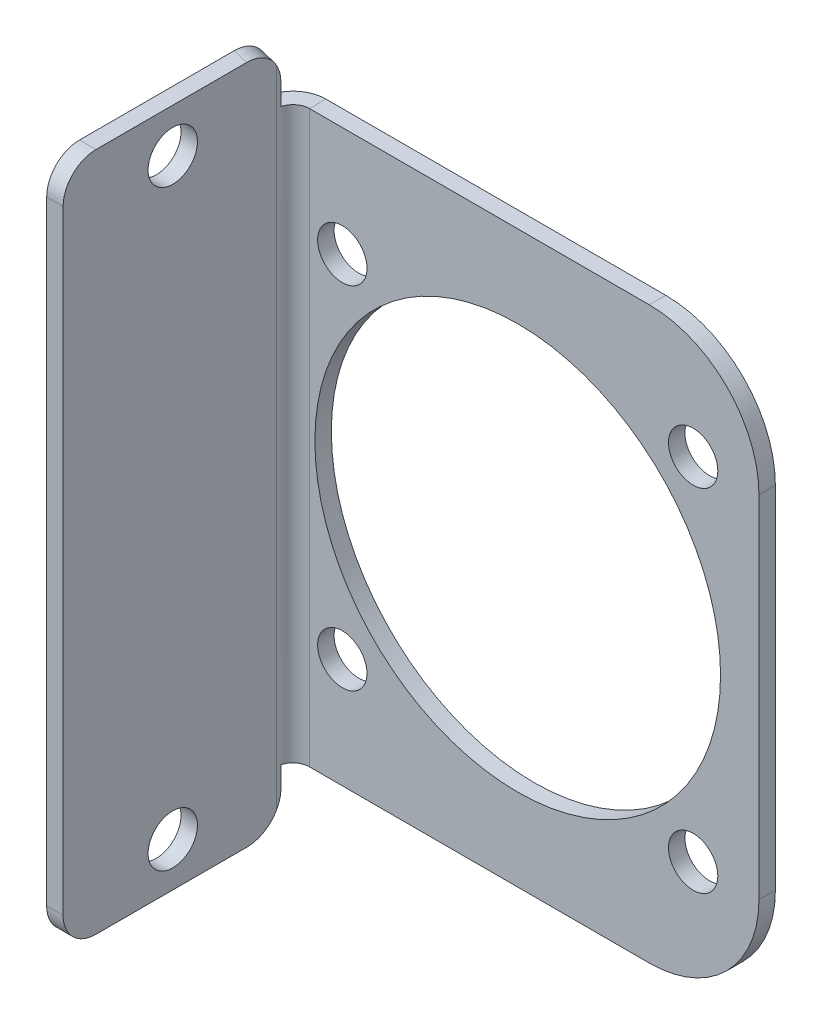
ISO-10303-21;
HEADER;
FILE_DESCRIPTION(('STEP AP214'),'2;1');
FILE_NAME('part.step','',(''),(''),'','','');
FILE_SCHEMA(('AUTOMOTIVE_DESIGN { 1 0 10303 214 1 1 1 1 }'));
ENDSEC;
DATA;
#1=APPLICATION_CONTEXT('core data for automotive mechanical design processes');
#2=APPLICATION_PROTOCOL_DEFINITION('international standard','automotive_design',2000,#1);
#3=PRODUCT_CONTEXT('',#1,'mechanical');
#4=PRODUCT('Part','Part','',(#3));
#5=PRODUCT_RELATED_PRODUCT_CATEGORY('part','',(#4));
#6=PRODUCT_DEFINITION_FORMATION('','',#4);
#7=PRODUCT_DEFINITION_CONTEXT('part definition',#1,'design');
#8=PRODUCT_DEFINITION('design','',#6,#7);
#9=PRODUCT_DEFINITION_SHAPE('','',#8);
#10=(LENGTH_UNIT() NAMED_UNIT(*) SI_UNIT(.MILLI.,.METRE.));
#11=(NAMED_UNIT(*) PLANE_ANGLE_UNIT() SI_UNIT($,.RADIAN.));
#12=(NAMED_UNIT(*) SI_UNIT($,.STERADIAN.) SOLID_ANGLE_UNIT());
#13=UNCERTAINTY_MEASURE_WITH_UNIT(LENGTH_MEASURE(1.E-05),#10,'distance_accuracy_value','');
#14=(GEOMETRIC_REPRESENTATION_CONTEXT(3) GLOBAL_UNCERTAINTY_ASSIGNED_CONTEXT((#13)) GLOBAL_UNIT_ASSIGNED_CONTEXT((#10,
#11,#12)) REPRESENTATION_CONTEXT('',''));
#15=CARTESIAN_POINT('',(0.,0.,0.));
#16=DIRECTION('',(0.,0.,1.));
#17=DIRECTION('',(1.,0.,0.));
#18=AXIS2_PLACEMENT_3D('',#15,#16,#17);
#19=CARTESIAN_POINT('',(-3.89372763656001,37.7009803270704,0.966278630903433));
#20=DIRECTION('',(0.000114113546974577,0.999999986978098,0.000114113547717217));
#21=DIRECTION('',(-1.30218982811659E-08,-0.00011411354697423,0.999999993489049));
#22=AXIS2_PLACEMENT_3D('',#19,#20,#21);
#23=PLANE('',#22);
#24=DIRECTION('',(-1.30218982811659E-08,-0.00011411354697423,0.999999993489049));
#25=VECTOR('',#24,1.);
#26=CARTESIAN_POINT('',(-2.39372764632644,37.7008091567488,0.966278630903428));
#27=LINE('',#26,#25);
#28=CARTESIAN_POINT('',(-2.3937276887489,37.7004374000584,4.22405737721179));
#29=VERTEX_POINT('',#28);
#30=CARTESIAN_POINT('',(-2.39372786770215,37.6988691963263,17.9665425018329));
#31=VERTEX_POINT('',#30);
#32=EDGE_CURVE('E389',#29,#31,#27,.T.);
#33=ORIENTED_EDGE('',*,*,#32,.F.);
#34=CARTESIAN_POINT('',(-0.89541909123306,34.6997886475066,1.49975198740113));
#35=CARTESIAN_POINT('',(-0.894891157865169,37.7005772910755,1.4993277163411));
#36=CARTESIAN_POINT('',(-1.6005679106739,37.7003249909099,4.41596159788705));
#37=CARTESIAN_POINT('',(-1.13848196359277,34.6998991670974,1.44094314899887));
#38=CARTESIAN_POINT('',(-1.13796885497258,37.7006117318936,1.44059359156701));
#39=CARTESIAN_POINT('',(-1.84363076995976,37.7003594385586,4.35715277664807));
#40=CARTESIAN_POINT('',(-1.38154483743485,34.700009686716,1.3821343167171));
#41=CARTESIAN_POINT('',(-1.38104963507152,37.7006461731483,1.38185872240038));
#42=CARTESIAN_POINT('',(-2.08669363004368,37.700393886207,4.29834395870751));
#43=CARTESIAN_POINT('',(-1.7461391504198,34.7001754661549,1.29392107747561));
#44=CARTESIAN_POINT('',(-1.7456731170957,37.7006978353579,1.29375586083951));
#45=CARTESIAN_POINT('',(-2.45128792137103,37.7004455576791,4.21013073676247));
#46=CARTESIAN_POINT('',(-1.86767058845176,34.7002307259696,1.26451666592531));
#47=CARTESIAN_POINT('',(-1.86721350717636,37.7007150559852,1.26438842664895));
#48=CARTESIAN_POINT('',(-2.57281935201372,37.7004627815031,4.18072633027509));
#49=CARTESIAN_POINT('',(-2.11014188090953,34.7003409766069,1.20585097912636));
#50=CARTESIAN_POINT('',(-2.10970266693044,37.7007494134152,1.2057965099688));
#51=CARTESIAN_POINT('',(-2.81529062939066,37.7004971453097,4.1220606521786));
#52=CARTESIAN_POINT('',(-2.23108173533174,34.7003959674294,1.17658970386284));
#53=CARTESIAN_POINT('',(-2.23065142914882,37.7007665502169,1.17657202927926));
#54=CARTESIAN_POINT('',(-2.93623047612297,37.7005142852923,4.09279938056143));
#55=CARTESIAN_POINT('',(-2.35202159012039,34.7004509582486,1.14732843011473));
#56=CARTESIAN_POINT('',(-2.35160095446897,37.7007836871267,1.14734736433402));
#57=CARTESIAN_POINT('',(-3.05717032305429,37.7005314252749,4.06353810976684));
#58=CARTESIAN_POINT('',(-2.35261317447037,34.700451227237,1.14718529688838));
#59=CARTESIAN_POINT('',(-2.3521925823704,37.7007837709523,1.1472044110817));
#60=CARTESIAN_POINT('',(-3.05776190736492,37.7005315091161,4.06339497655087));
#61=CARTESIAN_POINT('',(-2.35320475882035,34.7004514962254,1.14704216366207));
#62=CARTESIAN_POINT('',(-2.3527842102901,37.700783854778,1.14706145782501));
#63=CARTESIAN_POINT('',(-3.05835349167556,37.7005315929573,4.06325184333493));
#64=CARTESIAN_POINT('',(-2.55189607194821,34.7005418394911,1.09896900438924));
#65=CARTESIAN_POINT('',(-2.55148810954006,37.700812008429,1.09904923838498));
#66=CARTESIAN_POINT('',(-3.25704479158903,37.7005597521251,4.01517868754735));
#67=CARTESIAN_POINT('',(-2.74999580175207,34.7006319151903,1.05103898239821));
#68=CARTESIAN_POINT('',(-2.74960242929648,37.7008400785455,1.05117948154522));
#69=CARTESIAN_POINT('',(-3.45514450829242,37.7005878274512,3.96724866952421));
#70=CARTESIAN_POINT('',(-3.06962697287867,34.7007772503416,0.973704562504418));
#71=CARTESIAN_POINT('',(-3.06925841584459,37.7008853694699,0.973941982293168));
#72=CARTESIAN_POINT('',(-3.77477565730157,37.7006331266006,3.88991425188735));
#73=CARTESIAN_POINT('',(-3.1911584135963,34.7008325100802,0.944300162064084));
#74=CARTESIAN_POINT('',(-3.19079880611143,37.7009025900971,0.944574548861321));
#75=CARTESIAN_POINT('',(-3.89630708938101,37.7006503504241,3.86050985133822));
#76=CARTESIAN_POINT('',(-3.43422129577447,34.7009430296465,0.885491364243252));
#77=CARTESIAN_POINT('',(-3.43387958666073,37.7009370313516,0.885839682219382));
#78=CARTESIAN_POINT('',(-4.13936995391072,37.7006847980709,3.80170105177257));
#79=CARTESIAN_POINT('',(-3.55575273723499,34.7009982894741,0.856086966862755));
#80=CARTESIAN_POINT('',(-3.55541997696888,37.7009542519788,0.856472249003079));
#81=CARTESIAN_POINT('',(-4.26090138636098,37.7007020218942,3.77229665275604));
#82=CARTESIAN_POINT('',(-3.72150784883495,34.7010736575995,0.815982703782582));
#83=CARTESIAN_POINT('',(-3.72118796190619,37.7009777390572,0.816418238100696));
#84=CARTESIAN_POINT('',(-4.42665648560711,37.7007255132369,3.7321923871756));
#85=CARTESIAN_POINT('',(-3.76573151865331,34.7010937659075,0.805282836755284));
#86=CARTESIAN_POINT('',(-3.76541488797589,37.7009840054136,0.805731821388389));
#87=CARTESIAN_POINT('',(-4.47088015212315,37.7007317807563,3.72149251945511));
#88=CARTESIAN_POINT('',(-3.8099551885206,34.7011138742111,0.794582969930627));
#89=CARTESIAN_POINT('',(-3.80964191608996,37.7009902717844,0.795045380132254));
#90=CARTESIAN_POINT('',(-4.51510381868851,37.7007380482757,3.71079265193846));
#91=CARTESIAN_POINT('',(-3.88726296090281,34.7011490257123,0.775878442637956));
#92=CARTESIAN_POINT('',(-3.88695600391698,37.7010012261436,0.77636421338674));
#93=CARTESIAN_POINT('',(-4.59241158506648,37.7007490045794,3.6920881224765));
#94=CARTESIAN_POINT('',(-3.96457073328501,34.7011841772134,0.757173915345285));
#95=CARTESIAN_POINT('',(-3.96426946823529,37.7010121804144,0.75768319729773));
#96=CARTESIAN_POINT('',(-4.66971935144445,37.7007599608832,3.67338359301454));
#97=CARTESIAN_POINT('',(-4.04187850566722,34.7012193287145,0.738469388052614));
#98=CARTESIAN_POINT('',(-4.04158230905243,37.7010231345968,0.739002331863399));
#99=CARTESIAN_POINT('',(-4.74702711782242,37.700770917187,3.65467906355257));
#100=(BOUNDED_SURFACE() B_SPLINE_SURFACE(3,2,((#34,#35,#36),(#37,#38,#39),(#40,#41,#42),(#43,
#44,#45),(#46,#47,#48),(#49,#50,#51),(#52,#53,#54),(#55,#56,#57),(#58,#59,#60),(#61,#62,#63),
(#64,#65,#66),(#67,#68,#69),(#70,#71,#72),(#73,#74,#75),(#76,#77,#78),(#79,#80,#81),(#82,#83,
#84),(#85,#86,#87),(#88,#89,#90),(#91,#92,#93),(#94,#95,#96),(#97,#98,#99)),.UNSPECIFIED.,.F.,
.F.,.F.) B_SPLINE_SURFACE_WITH_KNOTS((4,2,2,3,2,2,2,2,3,4),(3,3),(0.,0.75022815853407,
1.1253422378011,1.49863035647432,1.50045631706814,2.11190301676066,2.4870170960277,
2.86213117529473,2.99863018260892,3.23724525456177),(0.,1.),
.UNSPECIFIED.) GEOMETRIC_REPRESENTATION_ITEM() RATIONAL_B_SPLINE_SURFACE(((1.,0.707013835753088,
1.),(1.,0.707022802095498,1.),(1.,0.707031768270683,1.),(1.,0.707045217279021,1.),(1.,
0.707049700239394,1.),(1.,0.707058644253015,1.),(1.,0.707063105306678,1.),(1.,0.707067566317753,
1.),(1.,0.707067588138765,1.),(1.,0.707067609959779,1.),(1.,0.707074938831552,1.),(1.,
0.707082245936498,1.),(1.,0.707094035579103,1.),(1.,0.707098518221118,1.),(1.,0.707107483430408,
1.),(1.,0.707111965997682,1.),(1.,0.70711807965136,1.),(1.,0.707119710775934,1.),(1.,
0.707121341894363,1.),(1.,0.707124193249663,1.),(1.,0.707127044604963,1.),(1.,0.707129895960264,1.))) REPRESENTATION_ITEM('') SURFACE());
#101=CARTESIAN_POINT('',(-1.6005679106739,37.7003249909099,4.41596159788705));
#102=CARTESIAN_POINT('',(-1.84363076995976,37.7003594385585,4.35715277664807));
#103=CARTESIAN_POINT('',(-2.08669363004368,37.700393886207,4.29834395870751));
#104=CARTESIAN_POINT('',(-2.45128792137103,37.7004455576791,4.21013073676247));
#105=CARTESIAN_POINT('',(-2.57281935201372,37.7004627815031,4.18072633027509));
#106=CARTESIAN_POINT('',(-2.81529062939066,37.7004971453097,4.1220606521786));
#107=CARTESIAN_POINT('',(-2.93623047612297,37.7005142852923,4.09279938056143));
#108=CARTESIAN_POINT('',(-3.05717032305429,37.7005314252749,4.06353810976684));
#109=CARTESIAN_POINT('',(-3.05776190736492,37.7005315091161,4.06339497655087));
#110=CARTESIAN_POINT('',(-3.05835349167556,37.7005315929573,4.06325184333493));
#111=CARTESIAN_POINT('',(-3.25704479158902,37.7005597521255,4.01517868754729));
#112=CARTESIAN_POINT('',(-3.45514450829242,37.7005878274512,3.9672486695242));
#113=CARTESIAN_POINT('',(-3.77477565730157,37.7006331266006,3.88991425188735));
#114=CARTESIAN_POINT('',(-3.89630708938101,37.7006503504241,3.86050985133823));
#115=CARTESIAN_POINT('',(-4.13936995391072,37.7006847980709,3.80170105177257));
#116=CARTESIAN_POINT('',(-4.26090138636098,37.7007020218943,3.77229665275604));
#117=CARTESIAN_POINT('',(-4.42665648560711,37.7007255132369,3.7321923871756));
#118=CARTESIAN_POINT('',(-4.47088015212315,37.7007317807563,3.72149251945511));
#119=CARTESIAN_POINT('',(-4.51510381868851,37.7007380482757,3.71079265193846));
#120=CARTESIAN_POINT('',(-4.59241158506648,37.7007490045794,3.6920881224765));
#121=CARTESIAN_POINT('',(-4.66971935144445,37.7007599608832,3.67338359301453));
#122=CARTESIAN_POINT('',(-4.74702711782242,37.700770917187,3.65467906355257));
#123=B_SPLINE_CURVE_WITH_KNOTS('',3,(#101,#102,#103,#104,#105,#106,#107,#108,#109,#110,#111,
#112,#113,#114,#115,#116,#117,#118,#119,#120,#121,#122),.UNSPECIFIED.,.F.,.F.,(4,2,2,3,2,2,2,2,
3,4),(0.,0.75022815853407,1.1253422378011,1.49863035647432,1.50045631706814,2.11190301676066,
2.4870170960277,2.86213117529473,2.99863018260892,3.23724525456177),.UNSPECIFIED.);
#124=CARTESIAN_POINT('',(-3.89372767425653,37.7006499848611,3.86113393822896));
#125=VERTEX_POINT('',#124);
#126=EDGE_CURVE('E395',#29,#125,#123,.T.);
#127=ORIENTED_EDGE('',*,*,#126,.T.);
#128=DIRECTION('',(-1.30218982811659E-08,-0.00011411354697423,0.999999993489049));
#129=VECTOR('',#128,1.);
#130=CARTESIAN_POINT('',(-3.89372763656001,37.7009803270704,0.966278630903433));
#131=LINE('',#130,#129);
#132=CARTESIAN_POINT('',(-3.89372785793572,37.6990403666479,17.9665425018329));
#133=VERTEX_POINT('',#132);
#134=EDGE_CURVE('E376',#125,#133,#131,.T.);
#135=ORIENTED_EDGE('',*,*,#134,.T.);
#136=DIRECTION('',(0.999999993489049,-0.000114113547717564,0.));
#137=VECTOR('',#136,1.);
#138=CARTESIAN_POINT('',(-3.89372785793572,37.6990403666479,17.9665425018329));
#139=LINE('',#138,#137);
#140=EDGE_CURVE('E541',#133,#31,#139,.T.);
#141=ORIENTED_EDGE('',*,*,#140,.T.);
#142=EDGE_LOOP('',(#33,#127,#135,#141));
#143=FACE_BOUND('',#142,.T.);
#144=ADVANCED_FACE('F80',(#143),#23,.T.);
#145=CARTESIAN_POINT('',(-3.90080293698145,-24.3013017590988,20.9646593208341));
#146=DIRECTION('',(-0.000114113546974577,-0.999999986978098,-0.000114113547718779));
#147=DIRECTION('',(1.30218982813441E-08,0.000114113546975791,-0.999999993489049));
#148=AXIS2_PLACEMENT_3D('',#145,#146,#147);
#149=PLANE('',#148);
#150=DIRECTION('',(1.30218982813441E-08,0.000114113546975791,-0.999999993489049));
#151=VECTOR('',#150,1.);
#152=CARTESIAN_POINT('',(-2.40080294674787,-24.3014729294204,20.9646593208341));
#153=LINE('',#152,#151);
#154=CARTESIAN_POINT('',(-2.40080290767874,-24.3011305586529,17.9643953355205));
#155=VERTEX_POINT('',#154);
#156=CARTESIAN_POINT('',(-2.40080272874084,-24.2995624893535,4.2230882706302));
#157=VERTEX_POINT('',#156);
#158=EDGE_CURVE('E373',#155,#157,#153,.T.);
#159=ORIENTED_EDGE('',*,*,#158,.F.);
#160=DIRECTION('',(0.999999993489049,-0.000114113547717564,0.));
#161=VECTOR('',#160,1.);
#162=CARTESIAN_POINT('',(-3.90080289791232,-24.3009593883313,17.9643953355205));
#163=LINE('',#162,#161);
#164=CARTESIAN_POINT('',(-3.90080289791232,-24.3009593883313,17.9643953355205));
#165=VERTEX_POINT('',#164);
#166=EDGE_CURVE('E679',#155,#165,#163,.F.);
#167=ORIENTED_EDGE('',*,*,#166,.T.);
#168=DIRECTION('',(1.30218982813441E-08,0.000114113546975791,-0.999999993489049));
#169=VECTOR('',#168,1.);
#170=CARTESIAN_POINT('',(-3.90080293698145,-24.3013017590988,20.9646593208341));
#171=LINE('',#170,#169);
#172=CARTESIAN_POINT('',(-3.90080271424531,-24.2993498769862,3.85992327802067));
#173=VERTEX_POINT('',#172);
#174=EDGE_CURVE('E673',#165,#173,#171,.T.);
#175=ORIENTED_EDGE('',*,*,#174,.T.);
#176=CARTESIAN_POINT('',(-1.60805115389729,-24.299674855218,4.41502138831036));
#177=CARTESIAN_POINT('',(-0.902301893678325,-24.2994227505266,1.50002797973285));
#178=CARTESIAN_POINT('',(-0.901774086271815,-21.3002114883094,1.49960381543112));
#179=CARTESIAN_POINT('',(-1.85110509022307,-24.2996404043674,4.35617558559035));
#180=CARTESIAN_POINT('',(-1.14534103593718,-24.2993882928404,1.44110748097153));
#181=CARTESIAN_POINT('',(-1.14482803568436,-21.300100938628,1.44075799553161));
#182=CARTESIAN_POINT('',(-2.094159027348,-24.2996059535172,4.2973297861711));
#183=CARTESIAN_POINT('',(-1.38837709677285,-24.2993538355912,1.38218772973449));
#184=CARTESIAN_POINT('',(-1.38788198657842,-21.2999903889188,1.38191218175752));
#185=CARTESIAN_POINT('',(-2.45873993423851,-24.2995542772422,4.20906109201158));
#186=CARTESIAN_POINT('',(-1.75292887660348,-24.2993021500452,1.29380866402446));
#187=CARTESIAN_POINT('',(-1.7524629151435,-21.299824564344,1.29364347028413));
#188=CARTESIAN_POINT('',(-2.58026690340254,-24.2995370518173,4.17963819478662));
#189=CARTESIAN_POINT('',(-1.87444690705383,-24.2992849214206,1.26434878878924));
#190=CARTESIAN_POINT('',(-1.87398989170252,-21.2997692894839,1.26422056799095));
#191=CARTESIAN_POINT('',(-2.82272906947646,-24.2995026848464,4.1209356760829));
#192=CARTESIAN_POINT('',(-2.11689123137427,-24.2992505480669,1.20557249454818));
#193=CARTESIAN_POINT('',(-2.11645207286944,-21.2996590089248,1.20551804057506));
#194=CARTESIAN_POINT('',(-2.94366426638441,-24.2994855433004,4.09165605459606));
#195=CARTESIAN_POINT('',(-2.2378175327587,-24.2992334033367,1.17625607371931));
#196=CARTESIAN_POINT('',(-2.23738727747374,-21.2996040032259,1.17623841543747));
#197=CARTESIAN_POINT('',(-3.06459946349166,-24.2994684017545,4.06237643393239));
#198=CARTESIAN_POINT('',(-2.35874307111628,-24.2992162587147,1.14693983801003));
#199=CARTESIAN_POINT('',(-2.35832248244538,-21.2995489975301,1.14695879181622));
#200=CARTESIAN_POINT('',(-3.06519123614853,-24.2994683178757,4.06223315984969));
#201=CARTESIAN_POINT('',(-2.35933480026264,-24.2992161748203,1.14679638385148));
#202=CARTESIAN_POINT('',(-2.35891425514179,-21.2995487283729,1.14681551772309));
#203=CARTESIAN_POINT('',(-3.0657830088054,-24.2994682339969,4.06208988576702));
#204=CARTESIAN_POINT('',(-2.35992652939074,-24.299216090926,1.14665292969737));
#205=CARTESIAN_POINT('',(-2.3595060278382,-21.2995484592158,1.14667224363));
#206=CARTESIAN_POINT('',(-3.2643133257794,-24.2994400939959,4.01402370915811));
#207=CARTESIAN_POINT('',(-2.55844428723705,-24.2991879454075,1.09852584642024));
#208=CARTESIAN_POINT('',(-2.55803635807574,-21.2994581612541,1.09860606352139));
#209=CARTESIAN_POINT('',(-3.46225187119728,-24.2994120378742,3.9661008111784));
#210=CARTESIAN_POINT('',(-2.75636827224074,-24.299159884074,1.05054271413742));
#211=CARTESIAN_POINT('',(-2.7559749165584,-21.2993681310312,1.05068316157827));
#212=CARTESIAN_POINT('',(-3.78171738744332,-24.2993667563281,3.88875502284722));
#213=CARTESIAN_POINT('',(-3.07580901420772,-24.2991145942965,0.973100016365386));
#214=CARTESIAN_POINT('',(-3.07544045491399,-21.2992228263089,0.973337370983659));
#215=CARTESIAN_POINT('',(-3.90324435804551,-24.2993495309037,3.8593321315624));
#216=CARTESIAN_POINT('',(-3.1973270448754,-24.2990973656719,0.9436401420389));
#217=CARTESIAN_POINT('',(-3.19696743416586,-21.2991675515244,0.943914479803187));
#218=CARTESIAN_POINT('',(-4.14629829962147,-24.299315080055,3.8004863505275));
#219=CARTESIAN_POINT('',(-3.44036310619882,-24.2990629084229,0.884720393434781));
#220=CARTESIAN_POINT('',(-3.44002139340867,-21.299057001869,0.885068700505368));
#221=CARTESIAN_POINT('',(-4.26782527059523,-24.2992978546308,3.77106346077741));
#222=CARTESIAN_POINT('',(-3.56188113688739,-24.2990456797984,0.855260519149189));
#223=CARTESIAN_POINT('',(-3.5615483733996,-21.2990017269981,0.855645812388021));
#224=CARTESIAN_POINT('',(-4.43372792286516,-24.2992743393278,3.73089677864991));
#225=CARTESIAN_POINT('',(-3.72777091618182,-24.2990221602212,0.815043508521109));
#226=CARTESIAN_POINT('',(-3.72745103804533,-21.2989262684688,0.815479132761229));
#227=CARTESIAN_POINT('',(-4.47810360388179,-24.2992680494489,3.72015298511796));
#228=CARTESIAN_POINT('',(-3.77214333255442,-24.2990158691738,0.804286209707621));
#229=CARTESIAN_POINT('',(-3.77182672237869,-21.2989060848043,0.804735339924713));
#230=CARTESIAN_POINT('',(-4.52247928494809,-24.2992617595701,3.70940919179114));
#231=CARTESIAN_POINT('',(-3.81651564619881,-24.299009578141,0.793528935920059));
#232=CARTESIAN_POINT('',(-3.81620240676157,-21.2988859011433,0.79399154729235));
#233=CARTESIAN_POINT('',(-4.59963057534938,-24.2992508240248,3.69073009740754));
#234=CARTESIAN_POINT('',(-3.89366063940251,-24.298998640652,0.774826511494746));
#235=CARTESIAN_POINT('',(-3.89335370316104,-21.2988508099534,0.775312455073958));
#236=CARTESIAN_POINT('',(-4.67678186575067,-24.2992398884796,3.67205100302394));
#237=CARTESIAN_POINT('',(-3.97080625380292,-24.298987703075,0.756123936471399));
#238=CARTESIAN_POINT('',(-3.97050499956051,-21.2988157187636,0.756633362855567));
#239=CARTESIAN_POINT('',(-4.75393315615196,-24.2992289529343,3.65337190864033));
#240=CARTESIAN_POINT('',(-4.04795248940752,-24.2989767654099,0.737421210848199));
#241=CARTESIAN_POINT('',(-4.04765629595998,-21.2987806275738,0.737954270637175));
#242=(BOUNDED_SURFACE() B_SPLINE_SURFACE(3,2,((#176,#177,#178),(#179,#180,#181),(#182,#183,
#184),(#185,#186,#187),(#188,#189,#190),(#191,#192,#193),(#194,#195,#196),(#197,#198,#199),
(#200,#201,#202),(#203,#204,#205),(#206,#207,#208),(#209,#210,#211),(#212,#213,#214),(#215,#216,
#217),(#218,#219,#220),(#221,#222,#223),(#224,#225,#226),(#227,#228,#229),(#230,#231,#232),
(#233,#234,#235),(#236,#237,#238),(#239,#240,#241)),.UNSPECIFIED.,.F.,.F.,
.F.) B_SPLINE_SURFACE_WITH_KNOTS((4,2,2,3,2,2,2,2,3,4),(3,3),(0.,0.750228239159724,
1.12534235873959,1.49862986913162,1.50045647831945,2.1114282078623,2.48654232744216,
2.86165644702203,2.99862969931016,3.23677056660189),(0.,1.),
.UNSPECIFIED.) GEOMETRIC_REPRESENTATION_ITEM() RATIONAL_B_SPLINE_SURFACE(((1.,0.707199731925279,
1.),(1.,0.707190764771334,1.),(1.,0.707181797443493,1.),(1.,0.707168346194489,1.),(1.,
0.707163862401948,1.),(1.,0.707154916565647,1.),(1.,0.707150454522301,1.),(1.,0.707145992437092,
1.),(1.,0.707145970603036,1.),(1.,0.707145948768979,1.),(1.,0.707138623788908,1.),(1.,
0.707131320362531,1.),(1.,0.707119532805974,1.),(1.,0.707115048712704,1.),(1.,0.707106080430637,
1.),(1.,0.70710159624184,1.),(1.,0.707095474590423,1.),(1.,0.707093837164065,1.),(1.,
0.707092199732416,1.),(1.,0.707089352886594,1.),(1.,0.707086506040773,1.),(1.,0.707083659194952,1.))) REPRESENTATION_ITEM('') SURFACE());
#243=CARTESIAN_POINT('',(-4.75393315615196,-24.2992289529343,3.65337190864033));
#244=CARTESIAN_POINT('',(-4.67678186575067,-24.2992398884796,3.67205100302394));
#245=CARTESIAN_POINT('',(-4.59963057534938,-24.2992508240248,3.69073009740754));
#246=CARTESIAN_POINT('',(-4.52247928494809,-24.2992617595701,3.70940919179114));
#247=CARTESIAN_POINT('',(-4.47810360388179,-24.2992680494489,3.72015298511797));
#248=CARTESIAN_POINT('',(-4.43372792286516,-24.2992743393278,3.73089677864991));
#249=CARTESIAN_POINT('',(-4.26782527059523,-24.2992978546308,3.77106346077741));
#250=CARTESIAN_POINT('',(-4.14629829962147,-24.299315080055,3.8004863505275));
#251=CARTESIAN_POINT('',(-3.90324435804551,-24.2993495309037,3.8593321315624));
#252=CARTESIAN_POINT('',(-3.78171738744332,-24.2993667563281,3.88875502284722));
#253=CARTESIAN_POINT('',(-3.46225187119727,-24.2994120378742,3.9661008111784));
#254=CARTESIAN_POINT('',(-3.26431332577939,-24.299440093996,4.01402370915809));
#255=CARTESIAN_POINT('',(-3.0657830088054,-24.2994682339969,4.06208988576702));
#256=CARTESIAN_POINT('',(-3.06519123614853,-24.2994683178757,4.06223315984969));
#257=CARTESIAN_POINT('',(-3.06459946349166,-24.2994684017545,4.06237643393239));
#258=CARTESIAN_POINT('',(-2.94366426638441,-24.2994855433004,4.09165605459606));
#259=CARTESIAN_POINT('',(-2.82272906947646,-24.2995026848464,4.1209356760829));
#260=CARTESIAN_POINT('',(-2.58026690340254,-24.2995370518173,4.17963819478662));
#261=CARTESIAN_POINT('',(-2.45873993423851,-24.2995542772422,4.20906109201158));
#262=CARTESIAN_POINT('',(-2.094159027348,-24.2996059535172,4.2973297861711));
#263=CARTESIAN_POINT('',(-1.85110509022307,-24.2996404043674,4.35617558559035));
#264=CARTESIAN_POINT('',(-1.60805115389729,-24.299674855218,4.41502138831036));
#265=B_SPLINE_CURVE_WITH_KNOTS('',3,(#243,#244,#245,#246,#247,#248,#249,#250,#251,#252,#253,
#254,#255,#256,#257,#258,#259,#260,#261,#262,#263,#264),.UNSPECIFIED.,.F.,.F.,(4,3,2,2,2,2,3,2,
2,4),(0.,0.238140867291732,0.375114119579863,0.750228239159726,1.12534235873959,
1.73631408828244,1.73814069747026,2.1114282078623,2.48654232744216,3.23677056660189),.UNSPECIFIED.);
#266=EDGE_CURVE('E503',#173,#157,#265,.T.);
#267=ORIENTED_EDGE('',*,*,#266,.T.);
#268=EDGE_LOOP('',(#159,#167,#175,#267));
#269=FACE_BOUND('',#268,.T.);
#270=ADVANCED_FACE('F518',(#269),#149,.T.);
#271=CARTESIAN_POINT('',(-2.39802978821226,0.000273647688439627,-2.93232153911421));
#272=DIRECTION('',(0.999999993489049,-0.000114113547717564,0.));
#273=DIRECTION('',(1.30218982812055E-08,0.000114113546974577,-0.999999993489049));
#274=AXIS2_PLACEMENT_3D('',#271,#272,#273);
#275=PLANE('',#274);
#276=CARTESIAN_POINT('',(-2.40034636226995,-20.3003312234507,10.9596599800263));
#277=DIRECTION('',(0.999999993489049,-0.000114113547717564,0.));
#278=DIRECTION('',(1.30218982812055E-08,0.000114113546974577,-0.999999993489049));
#279=AXIS2_PLACEMENT_3D('',#276,#277,#278);
#280=CIRCLE('',#279,2.25);
#281=CARTESIAN_POINT('',(-2.40034633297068,-20.30007446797,8.70965999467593));
#282=VERTEX_POINT('',#281);
#283=EDGE_CURVE('E664',#282,#282,#280,.T.);
#284=ORIENTED_EDGE('',*,*,#283,.F.);
#285=EDGE_LOOP('',(#284));
#286=FACE_BOUND('',#285,.T.);
#287=CARTESIAN_POINT('',(-2.39418423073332,33.6996680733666,10.965822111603));
#288=DIRECTION('',(0.999999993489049,-0.000114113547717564,0.));
#289=DIRECTION('',(1.30218982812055E-08,0.000114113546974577,-0.999999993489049));
#290=AXIS2_PLACEMENT_3D('',#287,#288,#289);
#291=CIRCLE('',#290,2.25000000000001);
#292=CARTESIAN_POINT('',(-2.39418420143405,33.6999248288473,8.71582212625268));
#293=VERTEX_POINT('',#292);
#294=EDGE_CURVE('E686',#293,#293,#291,.T.);
#295=ORIENTED_EDGE('',*,*,#294,.F.);
#296=EDGE_LOOP('',(#295));
#297=FACE_BOUND('',#296,.T.);
#298=DIRECTION('',(0.000114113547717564,0.999999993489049,0.));
#299=VECTOR('',#298,1.);
#300=CARTESIAN_POINT('',(-2.39802978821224,0.000273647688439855,1.50000000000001));
#301=LINE('',#300,#299);
#302=CARTESIAN_POINT('',(-2.40062150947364,-22.7115015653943,1.50000000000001));
#303=VERTEX_POINT('',#302);
#304=CARTESIAN_POINT('',(-2.39390898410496,36.1117096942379,1.50000000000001));
#305=VERTEX_POINT('',#304);
#306=EDGE_CURVE('E516',#303,#305,#301,.T.);
#307=ORIENTED_EDGE('',*,*,#306,.T.);
#308=CARTESIAN_POINT('',(-2.39390898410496,36.1117096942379,1.50000000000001));
#309=CARTESIAN_POINT('',(-2.39390043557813,36.1866221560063,1.54107686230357));
#310=CARTESIAN_POINT('',(-2.39389209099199,36.2597474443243,1.58539470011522));
#311=CARTESIAN_POINT('',(-2.39387586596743,36.401930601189,1.68010865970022));
#312=CARTESIAN_POINT('',(-2.39386798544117,36.4709892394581,1.73050362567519));
#313=CARTESIAN_POINT('',(-2.39385275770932,36.6044329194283,1.83687095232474));
#314=CARTESIAN_POINT('',(-2.39384540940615,36.6688275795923,1.89283123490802));
#315=CARTESIAN_POINT('',(-2.39383127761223,36.7926673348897,2.00995440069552));
#316=CARTESIAN_POINT('',(-2.39382449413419,36.8521123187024,2.07111740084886));
#317=CARTESIAN_POINT('',(-2.3938050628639,37.0223924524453,2.26169307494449));
#318=CARTESIAN_POINT('',(-2.3937933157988,37.1253343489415,2.39832177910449));
#319=CARTESIAN_POINT('',(-2.39377254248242,37.3073751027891,2.68665324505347));
#320=CARTESIAN_POINT('',(-2.39376351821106,37.3864566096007,2.83836687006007));
#321=CARTESIAN_POINT('',(-2.39374824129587,37.5203312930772,3.15592105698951));
#322=CARTESIAN_POINT('',(-2.39374205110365,37.5745771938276,3.32199203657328));
#323=CARTESIAN_POINT('',(-2.39373288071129,37.6549391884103,3.66061461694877));
#324=CARTESIAN_POINT('',(-2.39372989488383,37.6811045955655,3.83315430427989));
#325=CARTESIAN_POINT('',(-2.3937282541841,37.6954823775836,4.04266164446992));
#326=CARTESIAN_POINT('',(-2.39372804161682,37.6973451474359,4.07894174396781));
#327=CARTESIAN_POINT('',(-2.39372775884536,37.6998231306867,4.1514966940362));
#328=CARTESIAN_POINT('',(-2.39372768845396,37.7004399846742,4.18777148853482));
#329=CARTESIAN_POINT('',(-2.3937276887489,37.7004374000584,4.22405737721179));
#330=B_SPLINE_CURVE_WITH_KNOTS('',3,(#308,#309,#310,#311,#312,#313,#314,#315,#316,#317,#318,
#319,#320,#321,#322,#323,#324,#325,#326,#327,#328,#329),.UNSPECIFIED.,.F.,.F.,(4,2,2,2,2,2,2,2,
2,2,4),(0.,0.256212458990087,0.512376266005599,0.76799578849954,1.02362105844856,
1.5342584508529,2.04526627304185,2.56704866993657,3.08791323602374,3.19688683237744,
3.30571684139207),.UNSPECIFIED.);
#331=EDGE_CURVE('E14',#305,#29,#330,.T.);
#332=ORIENTED_EDGE('',*,*,#331,.T.);
#333=ORIENTED_EDGE('',*,*,#32,.T.);
#334=CARTESIAN_POINT('',(-2.39407020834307,34.698869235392,17.9662001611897));
#335=DIRECTION('',(0.999999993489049,-0.000114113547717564,0.));
#336=DIRECTION('',(0.000114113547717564,0.999999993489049,0.));
#337=AXIS2_PLACEMENT_3D('',#334,#335,#336);
#338=CIRCLE('',#337,3.);
#339=CARTESIAN_POINT('',(-2.39407021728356,34.6987908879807,20.9662001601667));
#340=VERTEX_POINT('',#339);
#341=EDGE_CURVE('E936',#31,#340,#338,.T.);
#342=ORIENTED_EDGE('',*,*,#341,.T.);
#343=DIRECTION('',(-0.00011411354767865,-0.999999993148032,-2.61158039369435E-05));
#344=VECTOR('',#343,1.);
#345=CARTESIAN_POINT('',(-2.39372790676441,37.6985268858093,20.9662785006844));
#346=LINE('',#345,#344);
#347=CARTESIAN_POINT('',(-2.40046057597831,-21.30120894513,20.9647376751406));
#348=VERTEX_POINT('',#347);
#349=EDGE_CURVE('E377',#340,#348,#346,.T.);
#350=ORIENTED_EDGE('',*,*,#349,.T.);
#351=CARTESIAN_POINT('',(-2.40046056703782,-21.3011305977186,17.9647376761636));
#352=DIRECTION('',(0.999999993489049,-0.000114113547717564,0.));
#353=DIRECTION('',(0.000114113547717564,0.999999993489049,0.));
#354=AXIS2_PLACEMENT_3D('',#351,#352,#353);
#355=CIRCLE('',#354,3.);
#356=EDGE_CURVE('E371',#348,#155,#355,.T.);
#357=ORIENTED_EDGE('',*,*,#356,.T.);
#358=ORIENTED_EDGE('',*,*,#158,.T.);
#359=CARTESIAN_POINT('',(-2.40080272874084,-24.2995624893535,4.22308827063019));
#360=CARTESIAN_POINT('',(-2.40080272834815,-24.2995590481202,4.13438662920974));
#361=CARTESIAN_POINT('',(-2.40080230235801,-24.2958260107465,4.04568861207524));
#362=CARTESIAN_POINT('',(-2.40080060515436,-24.2809530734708,3.8689148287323));
#363=CARTESIAN_POINT('',(-2.40079933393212,-24.2698130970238,3.78083906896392));
#364=CARTESIAN_POINT('',(-2.40079595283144,-24.2401838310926,3.60595745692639));
#365=CARTESIAN_POINT('',(-2.40079384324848,-24.2216971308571,3.51915116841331));
#366=CARTESIAN_POINT('',(-2.40078880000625,-24.1775021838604,3.34742470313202));
#367=CARTESIAN_POINT('',(-2.40078586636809,-24.1517941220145,3.26250447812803));
#368=CARTESIAN_POINT('',(-2.40077584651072,-24.0639880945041,3.01136938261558));
#369=CARTESIAN_POINT('',(-2.40076754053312,-23.9912011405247,2.84873796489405));
#370=CARTESIAN_POINT('',(-2.40074789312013,-23.8190269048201,2.53828227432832));
#371=CARTESIAN_POINT('',(-2.4007365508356,-23.7196321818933,2.3904621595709));
#372=CARTESIAN_POINT('',(-2.40071127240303,-23.4981121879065,2.11584862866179));
#373=CARTESIAN_POINT('',(-2.40069737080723,-23.3762897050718,1.98881333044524));
#374=CARTESIAN_POINT('',(-2.40067483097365,-23.1787686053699,1.81573054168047));
#375=CARTESIAN_POINT('',(-2.40066704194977,-23.1105118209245,1.76097727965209));
#376=CARTESIAN_POINT('',(-2.40065094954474,-22.969490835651,1.65763955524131));
#377=CARTESIAN_POINT('',(-2.40064264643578,-22.8967290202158,1.60905186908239));
#378=CARTESIAN_POINT('',(-2.40062996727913,-22.7856190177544,1.54171757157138));
#379=CARTESIAN_POINT('',(-2.40062576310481,-22.7487769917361,1.52045507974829));
#380=CARTESIAN_POINT('',(-2.40062150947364,-22.7115015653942,1.50000000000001));
#381=B_SPLINE_CURVE_WITH_KNOTS('',3,(#359,#360,#361,#362,#363,#364,#365,#366,#367,#368,#369,
#370,#371,#372,#373,#374,#375,#376,#377,#378,#379,#380),.UNSPECIFIED.,.F.,.F.,(4,2,2,2,2,2,2,2,
2,2,4),(0.,0.26602082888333,0.532044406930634,0.797974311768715,1.06389740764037,
1.59561702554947,2.12748550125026,2.65263971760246,2.9148831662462,3.17698892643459,
3.3045582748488),.UNSPECIFIED.);
#382=EDGE_CURVE('E510',#157,#303,#381,.T.);
#383=ORIENTED_EDGE('',*,*,#382,.T.);
#384=EDGE_LOOP('',(#307,#332,#333,#342,#350,#357,#358,#383));
#385=FACE_BOUND('',#384,.T.);
#386=ADVANCED_FACE('F521',(#286,#297,#385),#275,.T.);
#387=CARTESIAN_POINT('',(-3.89372789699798,37.6986980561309,20.9662785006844));
#388=DIRECTION('',(-2.98016354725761E-09,-2.61158037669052E-05,0.999999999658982));
#389=DIRECTION('',(-0.00011411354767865,-0.999999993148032,-2.61158039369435E-05));
#390=AXIS2_PLACEMENT_3D('',#387,#388,#389);
#391=PLANE('',#390);
#392=ORIENTED_EDGE('',*,*,#349,.F.);
#393=DIRECTION('',(0.999999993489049,-0.000114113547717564,0.));
#394=VECTOR('',#393,1.);
#395=CARTESIAN_POINT('',(-3.89407020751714,34.6989620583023,20.9662001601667));
#396=LINE('',#395,#394);
#397=CARTESIAN_POINT('',(-3.89407020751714,34.6989620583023,20.9662001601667));
#398=VERTEX_POINT('',#397);
#399=EDGE_CURVE('E940',#340,#398,#396,.F.);
#400=ORIENTED_EDGE('',*,*,#399,.T.);
#401=DIRECTION('',(-0.00011411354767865,-0.999999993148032,-2.61158039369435E-05));
#402=VECTOR('',#401,1.);
#403=CARTESIAN_POINT('',(-3.89372789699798,37.6986980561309,20.9662785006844));
#404=LINE('',#403,#402);
#405=CARTESIAN_POINT('',(-3.90046056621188,-21.3010377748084,20.9647376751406));
#406=VERTEX_POINT('',#405);
#407=EDGE_CURVE('E674',#398,#406,#404,.T.);
#408=ORIENTED_EDGE('',*,*,#407,.T.);
#409=DIRECTION('',(0.999999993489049,-0.000114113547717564,0.));
#410=VECTOR('',#409,1.);
#411=CARTESIAN_POINT('',(-3.90046056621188,-21.3010377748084,20.9647376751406));
#412=LINE('',#411,#410);
#413=EDGE_CURVE('E368',#406,#348,#412,.T.);
#414=ORIENTED_EDGE('',*,*,#413,.T.);
#415=EDGE_LOOP('',(#392,#400,#408,#414));
#416=FACE_BOUND('',#415,.T.);
#417=ADVANCED_FACE('F721',(#416),#391,.T.);
#418=CARTESIAN_POINT('',(-3.89802977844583,0.000444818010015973,-2.93232153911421));
#419=DIRECTION('',(0.999999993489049,-0.000114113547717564,0.));
#420=DIRECTION('',(1.30218982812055E-08,0.000114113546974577,-0.999999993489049));
#421=AXIS2_PLACEMENT_3D('',#418,#419,#420);
#422=PLANE('',#421);
#423=ORIENTED_EDGE('',*,*,#134,.F.);
#424=CARTESIAN_POINT('',(-3.89372767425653,37.7006499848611,3.86113393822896));
#425=CARTESIAN_POINT('',(-3.89372767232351,37.7006669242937,3.77250172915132));
#426=CARTESIAN_POINT('',(-3.89372809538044,37.6969595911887,3.68387210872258));
#427=CARTESIAN_POINT('',(-3.89372978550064,37.6821487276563,3.50722979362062));
#428=CARTESIAN_POINT('',(-3.8937310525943,37.6710449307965,3.41921712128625));
#429=CARTESIAN_POINT('',(-3.89373442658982,37.6414779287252,3.24433486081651));
#430=CARTESIAN_POINT('',(-3.89373653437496,37.6230069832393,3.1574665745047));
#431=CARTESIAN_POINT('',(-3.89374157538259,37.5788316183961,2.9856169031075));
#432=CARTESIAN_POINT('',(-3.89374450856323,37.5531275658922,2.90063542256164));
#433=CARTESIAN_POINT('',(-3.89375453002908,37.4653074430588,2.6492637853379));
#434=CARTESIAN_POINT('',(-3.89376283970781,37.392488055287,2.48647387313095));
#435=CARTESIAN_POINT('',(-3.89378249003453,37.2202882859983,2.17598444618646));
#436=CARTESIAN_POINT('',(-3.89379382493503,37.120958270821,2.02825704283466));
#437=CARTESIAN_POINT('',(-3.89381300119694,36.9529128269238,1.81978943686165));
#438=CARTESIAN_POINT('',(-3.89381984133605,36.8929713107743,1.75183078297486));
#439=CARTESIAN_POINT('',(-3.89383417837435,36.7673329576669,1.62156963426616));
#440=CARTESIAN_POINT('',(-3.89384167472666,36.7016409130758,1.55926251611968));
#441=CARTESIAN_POINT('',(-3.89384947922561,36.6332485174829,1.50000000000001));
#442=B_SPLINE_CURVE_WITH_KNOTS('',3,(#424,#425,#426,#427,#428,#429,#430,#431,#432,#433,#434,
#435,#436,#437,#438,#439,#440,#441),.UNSPECIFIED.,.F.,.F.,(4,2,2,2,2,2,2,2,4),(0.,
0.265813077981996,0.531635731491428,0.797738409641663,1.0638275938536,1.59608839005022,
2.12734507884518,2.39887672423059,2.67018419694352),.UNSPECIFIED.);
#443=CARTESIAN_POINT('',(-3.89384947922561,36.633248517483,1.50000000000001));
#444=VERTEX_POINT('',#443);
#445=EDGE_CURVE('E402',#125,#444,#442,.T.);
#446=ORIENTED_EDGE('',*,*,#445,.T.);
#447=DIRECTION('',(0.000114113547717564,0.999999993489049,0.));
#448=VECTOR('',#447,1.);
#449=CARTESIAN_POINT('',(-3.89802977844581,0.000444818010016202,1.50000000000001));
#450=LINE('',#449,#448);
#451=CARTESIAN_POINT('',(-3.90068098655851,-23.2326256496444,1.50000000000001));
#452=VERTEX_POINT('',#451);
#453=EDGE_CURVE('E494',#452,#444,#450,.T.);
#454=ORIENTED_EDGE('',*,*,#453,.F.);
#455=CARTESIAN_POINT('',(-3.90068098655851,-23.2326256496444,1.50000000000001));
#456=CARTESIAN_POINT('',(-3.90068847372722,-23.2982372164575,1.55688097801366));
#457=CARTESIAN_POINT('',(-3.90069567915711,-23.3613798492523,1.61659577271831));
#458=CARTESIAN_POINT('',(-3.90070948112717,-23.482329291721,1.74118636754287));
#459=CARTESIAN_POINT('',(-3.90071607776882,-23.5401369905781,1.80606130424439));
#460=CARTESIAN_POINT('',(-3.90072861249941,-23.6499813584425,1.94041220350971));
#461=CARTESIAN_POINT('',(-3.90073455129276,-23.7020242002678,2.00988311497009));
#462=CARTESIAN_POINT('',(-3.90074574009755,-23.800073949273,2.15293551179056));
#463=CARTESIAN_POINT('',(-3.90075099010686,-23.8460808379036,2.22651700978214));
#464=CARTESIAN_POINT('',(-3.90076565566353,-23.9745980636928,2.45262251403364));
#465=CARTESIAN_POINT('',(-3.9007739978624,-24.0477024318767,2.61062726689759));
#466=CARTESIAN_POINT('',(-3.90078758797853,-24.1667953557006,2.93637058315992));
#467=CARTESIAN_POINT('',(-3.90079283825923,-24.2128046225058,3.10410160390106));
#468=CARTESIAN_POINT('',(-3.90079856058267,-24.2629504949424,3.37091001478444));
#469=CARTESIAN_POINT('',(-3.90080011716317,-24.2765911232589,3.46828950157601));
#470=CARTESIAN_POINT('',(-3.9008021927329,-24.2947797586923,3.66374139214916));
#471=CARTESIAN_POINT('',(-3.90080271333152,-24.2993418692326,3.76181248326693));
#472=CARTESIAN_POINT('',(-3.90080271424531,-24.2993498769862,3.85992327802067));
#473=B_SPLINE_CURVE_WITH_KNOTS('',3,(#455,#456,#457,#458,#459,#460,#461,#462,#463,#464,#465,
#466,#467,#468,#469,#470,#471,#472),.UNSPECIFIED.,.F.,.F.,(4,2,2,2,2,2,2,2,4),(0.,
0.260410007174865,0.52077653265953,0.780861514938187,1.04094729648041,1.56066150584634,
2.07997793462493,2.374584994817,2.66873402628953),.UNSPECIFIED.);
#474=EDGE_CURVE('E511',#452,#173,#473,.T.);
#475=ORIENTED_EDGE('',*,*,#474,.T.);
#476=ORIENTED_EDGE('',*,*,#174,.F.);
#477=CARTESIAN_POINT('',(-3.90046055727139,-21.3009594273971,17.9647376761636));
#478=DIRECTION('',(0.999999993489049,-0.000114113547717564,0.));
#479=DIRECTION('',(0.000114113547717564,0.999999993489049,0.));
#480=AXIS2_PLACEMENT_3D('',#477,#478,#479);
#481=CIRCLE('',#480,3.);
#482=EDGE_CURVE('E933',#165,#406,#481,.F.);
#483=ORIENTED_EDGE('',*,*,#482,.T.);
#484=ORIENTED_EDGE('',*,*,#407,.F.);
#485=CARTESIAN_POINT('',(-3.89407019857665,34.6990404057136,17.9662001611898));
#486=DIRECTION('',(0.999999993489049,-0.000114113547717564,0.));
#487=DIRECTION('',(0.000114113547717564,0.999999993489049,0.));
#488=AXIS2_PLACEMENT_3D('',#485,#486,#487);
#489=CIRCLE('',#488,3.);
#490=EDGE_CURVE('E403',#398,#133,#489,.F.);
#491=ORIENTED_EDGE('',*,*,#490,.T.);
#492=EDGE_LOOP('',(#423,#446,#454,#475,#476,#483,#484,#491));
#493=FACE_BOUND('',#492,.T.);
#494=CARTESIAN_POINT('',(-3.90034635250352,-20.3001600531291,10.9596599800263));
#495=DIRECTION('',(0.999999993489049,-0.000114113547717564,0.));
#496=DIRECTION('',(1.30218982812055E-08,0.000114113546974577,-0.999999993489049));
#497=AXIS2_PLACEMENT_3D('',#494,#495,#496);
#498=CIRCLE('',#497,2.25);
#499=CARTESIAN_POINT('',(-3.90034632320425,-20.2999032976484,8.70965999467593));
#500=VERTEX_POINT('',#499);
#501=EDGE_CURVE('E689',#500,#500,#498,.T.);
#502=ORIENTED_EDGE('',*,*,#501,.T.);
#503=EDGE_LOOP('',(#502));
#504=FACE_BOUND('',#503,.T.);
#505=CARTESIAN_POINT('',(-3.89418422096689,33.6998392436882,10.9658221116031));
#506=DIRECTION('',(0.999999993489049,-0.000114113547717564,0.));
#507=DIRECTION('',(1.30218982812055E-08,0.000114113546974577,-0.999999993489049));
#508=AXIS2_PLACEMENT_3D('',#505,#506,#507);
#509=CIRCLE('',#508,2.25000000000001);
#510=CARTESIAN_POINT('',(-3.89418419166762,33.7000959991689,8.71582212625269));
#511=VERTEX_POINT('',#510);
#512=EDGE_CURVE('E392',#511,#511,#509,.T.);
#513=ORIENTED_EDGE('',*,*,#512,.T.);
#514=EDGE_LOOP('',(#513));
#515=FACE_BOUND('',#514,.T.);
#516=ADVANCED_FACE('F719',(#493,#504,#515),#422,.F.);
#517=CARTESIAN_POINT('',(-3.89418422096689,33.6998392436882,10.9658221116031));
#518=DIRECTION('',(0.999999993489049,-0.000114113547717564,0.));
#519=DIRECTION('',(1.30218982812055E-08,0.000114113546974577,-0.999999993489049));
#520=AXIS2_PLACEMENT_3D('',#517,#518,#519);
#521=CYLINDRICAL_SURFACE('',#520,2.25000000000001);
#522=ORIENTED_EDGE('',*,*,#512,.F.);
#523=EDGE_LOOP('',(#522));
#524=FACE_BOUND('',#523,.T.);
#525=ORIENTED_EDGE('',*,*,#294,.T.);
#526=EDGE_LOOP('',(#525));
#527=FACE_BOUND('',#526,.T.);
#528=ADVANCED_FACE('F715',(#524,#527),#521,.F.);
#529=CARTESIAN_POINT('',(-3.90034635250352,-20.3001600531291,10.9596599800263));
#530=DIRECTION('',(0.999999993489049,-0.000114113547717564,0.));
#531=DIRECTION('',(1.30218982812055E-08,0.000114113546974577,-0.999999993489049));
#532=AXIS2_PLACEMENT_3D('',#529,#530,#531);
#533=CYLINDRICAL_SURFACE('',#532,2.25);
#534=ORIENTED_EDGE('',*,*,#501,.F.);
#535=EDGE_LOOP('',(#534));
#536=FACE_BOUND('',#535,.T.);
#537=ORIENTED_EDGE('',*,*,#283,.T.);
#538=EDGE_LOOP('',(#537));
#539=FACE_BOUND('',#538,.T.);
#540=ADVANCED_FACE('F712',(#536,#539),#533,.F.);
#541=CARTESIAN_POINT('',(40.1057019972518,-19.2990196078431,-1.5));
#542=DIRECTION('',(1.,0.,0.));
#543=DIRECTION('',(0.,0.,-1.));
#544=AXIS2_PLACEMENT_3D('',#541,#542,#543);
#545=PLANE('',#544);
#546=DIRECTION('',(0.,1.,0.));
#547=VECTOR('',#546,1.);
#548=CARTESIAN_POINT('',(40.1057019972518,-19.2990196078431,0.));
#549=LINE('',#548,#547);
#550=CARTESIAN_POINT('',(40.1057019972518,-9.29901960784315,0.));
#551=VERTEX_POINT('',#550);
#552=CARTESIAN_POINT('',(40.1057019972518,22.7009803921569,0.));
#553=VERTEX_POINT('',#552);
#554=EDGE_CURVE('E594',#551,#553,#549,.T.);
#555=ORIENTED_EDGE('',*,*,#554,.F.);
#556=DIRECTION('',(0.,0.,1.));
#557=VECTOR('',#556,1.);
#558=CARTESIAN_POINT('',(40.1057019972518,-9.29901960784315,-1.5));
#559=LINE('',#558,#557);
#560=CARTESIAN_POINT('',(40.1057019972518,-9.29901960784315,-1.5));
#561=VERTEX_POINT('',#560);
#562=EDGE_CURVE('E648',#551,#561,#559,.F.);
#563=ORIENTED_EDGE('',*,*,#562,.T.);
#564=DIRECTION('',(0.,1.,0.));
#565=VECTOR('',#564,1.);
#566=CARTESIAN_POINT('',(40.1057019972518,-19.2990196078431,-1.5));
#567=LINE('',#566,#565);
#568=CARTESIAN_POINT('',(40.1057019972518,22.7009803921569,-1.5));
#569=VERTEX_POINT('',#568);
#570=EDGE_CURVE('E629',#561,#569,#567,.T.);
#571=ORIENTED_EDGE('',*,*,#570,.T.);
#572=DIRECTION('',(0.,0.,1.));
#573=VECTOR('',#572,1.);
#574=CARTESIAN_POINT('',(40.1057019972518,22.7009803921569,-1.5));
#575=LINE('',#574,#573);
#576=EDGE_CURVE('E386',#569,#553,#575,.T.);
#577=ORIENTED_EDGE('',*,*,#576,.T.);
#578=EDGE_LOOP('',(#555,#563,#571,#577));
#579=FACE_BOUND('',#578,.T.);
#580=ADVANCED_FACE('F328',(#579),#545,.T.);
#581=CARTESIAN_POINT('',(34.1042184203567,-9.29901960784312,-1.5));
#582=DIRECTION('',(0.,0.,1.));
#583=DIRECTION('',(1.,0.,0.));
#584=AXIS2_PLACEMENT_3D('',#581,#582,#583);
#585=CYLINDRICAL_SURFACE('',#584,2.25);
#586=CARTESIAN_POINT('',(34.1042184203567,-9.29901960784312,-1.5));
#587=DIRECTION('',(0.,0.,1.));
#588=DIRECTION('',(1.,0.,0.));
#589=AXIS2_PLACEMENT_3D('',#586,#587,#588);
#590=CIRCLE('',#589,2.25);
#591=CARTESIAN_POINT('',(36.3542184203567,-9.29901960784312,-1.5));
#592=VERTEX_POINT('',#591);
#593=EDGE_CURVE('E598',#592,#592,#590,.T.);
#594=ORIENTED_EDGE('',*,*,#593,.F.);
#595=EDGE_LOOP('',(#594));
#596=FACE_BOUND('',#595,.T.);
#597=CARTESIAN_POINT('',(34.1042184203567,-9.29901960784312,0.));
#598=DIRECTION('',(0.,0.,1.));
#599=DIRECTION('',(1.,0.,0.));
#600=AXIS2_PLACEMENT_3D('',#597,#598,#599);
#601=CIRCLE('',#600,2.25);
#602=CARTESIAN_POINT('',(36.3542184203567,-9.29901960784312,0.));
#603=VERTEX_POINT('',#602);
#604=EDGE_CURVE('E626',#603,#603,#601,.T.);
#605=ORIENTED_EDGE('',*,*,#604,.T.);
#606=EDGE_LOOP('',(#605));
#607=FACE_BOUND('',#606,.T.);
#608=ADVANCED_FACE('F784',(#596,#607),#585,.F.);
#609=CARTESIAN_POINT('',(2.10421842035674,-9.29901960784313,-1.5));
#610=DIRECTION('',(0.,0.,1.));
#611=DIRECTION('',(1.,0.,0.));
#612=AXIS2_PLACEMENT_3D('',#609,#610,#611);
#613=CYLINDRICAL_SURFACE('',#612,2.25);
#614=CARTESIAN_POINT('',(2.10421842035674,-9.29901960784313,-1.5));
#615=DIRECTION('',(0.,0.,1.));
#616=DIRECTION('',(1.,0.,0.));
#617=AXIS2_PLACEMENT_3D('',#614,#615,#616);
#618=CIRCLE('',#617,2.25);
#619=CARTESIAN_POINT('',(4.35421842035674,-9.29901960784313,-1.5));
#620=VERTEX_POINT('',#619);
#621=EDGE_CURVE('E602',#620,#620,#618,.T.);
#622=ORIENTED_EDGE('',*,*,#621,.F.);
#623=EDGE_LOOP('',(#622));
#624=FACE_BOUND('',#623,.T.);
#625=CARTESIAN_POINT('',(2.10421842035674,-9.29901960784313,0.));
#626=DIRECTION('',(0.,0.,1.));
#627=DIRECTION('',(1.,0.,0.));
#628=AXIS2_PLACEMENT_3D('',#625,#626,#627);
#629=CIRCLE('',#628,2.25);
#630=CARTESIAN_POINT('',(4.35421842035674,-9.29901960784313,0.));
#631=VERTEX_POINT('',#630);
#632=EDGE_CURVE('E623',#631,#631,#629,.T.);
#633=ORIENTED_EDGE('',*,*,#632,.T.);
#634=EDGE_LOOP('',(#633));
#635=FACE_BOUND('',#634,.T.);
#636=ADVANCED_FACE('F792',(#624,#635),#613,.F.);
#637=CARTESIAN_POINT('',(2.10421842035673,22.7009803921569,-1.5));
#638=DIRECTION('',(0.,0.,1.));
#639=DIRECTION('',(1.,0.,0.));
#640=AXIS2_PLACEMENT_3D('',#637,#638,#639);
#641=CYLINDRICAL_SURFACE('',#640,2.25);
#642=CARTESIAN_POINT('',(2.10421842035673,22.7009803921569,-1.5));
#643=DIRECTION('',(0.,0.,1.));
#644=DIRECTION('',(1.,0.,0.));
#645=AXIS2_PLACEMENT_3D('',#642,#643,#644);
#646=CIRCLE('',#645,2.25);
#647=CARTESIAN_POINT('',(4.35421842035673,22.7009803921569,-1.5));
#648=VERTEX_POINT('',#647);
#649=EDGE_CURVE('E605',#648,#648,#646,.T.);
#650=ORIENTED_EDGE('',*,*,#649,.F.);
#651=EDGE_LOOP('',(#650));
#652=FACE_BOUND('',#651,.T.);
#653=CARTESIAN_POINT('',(2.10421842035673,22.7009803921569,0.));
#654=DIRECTION('',(0.,0.,1.));
#655=DIRECTION('',(1.,0.,0.));
#656=AXIS2_PLACEMENT_3D('',#653,#654,#655);
#657=CIRCLE('',#656,2.25);
#658=CARTESIAN_POINT('',(4.35421842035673,22.7009803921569,0.));
#659=VERTEX_POINT('',#658);
#660=EDGE_CURVE('E620',#659,#659,#657,.T.);
#661=ORIENTED_EDGE('',*,*,#660,.T.);
#662=EDGE_LOOP('',(#661));
#663=FACE_BOUND('',#662,.T.);
#664=ADVANCED_FACE('F801',(#652,#663),#641,.F.);
#665=CARTESIAN_POINT('',(34.1042184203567,22.7009803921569,-1.5));
#666=DIRECTION('',(0.,0.,1.));
#667=DIRECTION('',(1.,0.,0.));
#668=AXIS2_PLACEMENT_3D('',#665,#666,#667);
#669=CYLINDRICAL_SURFACE('',#668,2.25);
#670=CARTESIAN_POINT('',(34.1042184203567,22.7009803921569,-1.5));
#671=DIRECTION('',(0.,0.,1.));
#672=DIRECTION('',(1.,0.,0.));
#673=AXIS2_PLACEMENT_3D('',#670,#671,#672);
#674=CIRCLE('',#673,2.25);
#675=CARTESIAN_POINT('',(36.3542184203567,22.7009803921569,-1.5));
#676=VERTEX_POINT('',#675);
#677=EDGE_CURVE('E608',#676,#676,#674,.T.);
#678=ORIENTED_EDGE('',*,*,#677,.F.);
#679=EDGE_LOOP('',(#678));
#680=FACE_BOUND('',#679,.T.);
#681=CARTESIAN_POINT('',(34.1042184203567,22.7009803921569,0.));
#682=DIRECTION('',(0.,0.,1.));
#683=DIRECTION('',(1.,0.,0.));
#684=AXIS2_PLACEMENT_3D('',#681,#682,#683);
#685=CIRCLE('',#684,2.25);
#686=CARTESIAN_POINT('',(36.3542184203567,22.7009803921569,0.));
#687=VERTEX_POINT('',#686);
#688=EDGE_CURVE('E617',#687,#687,#685,.T.);
#689=ORIENTED_EDGE('',*,*,#688,.T.);
#690=EDGE_LOOP('',(#689));
#691=FACE_BOUND('',#690,.T.);
#692=ADVANCED_FACE('F811',(#680,#691),#669,.F.);
#693=CARTESIAN_POINT('',(18.1042184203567,6.70098039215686,-1.5));
#694=DIRECTION('',(0.,0.,1.));
#695=DIRECTION('',(1.,0.,0.));
#696=AXIS2_PLACEMENT_3D('',#693,#694,#695);
#697=CYLINDRICAL_SURFACE('',#696,18.5);
#698=CARTESIAN_POINT('',(18.1042184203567,6.70098039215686,-1.5));
#699=DIRECTION('',(0.,0.,1.));
#700=DIRECTION('',(1.,0.,0.));
#701=AXIS2_PLACEMENT_3D('',#698,#699,#700);
#702=CIRCLE('',#701,18.5);
#703=CARTESIAN_POINT('',(36.6042184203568,6.70098039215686,-1.5));
#704=VERTEX_POINT('',#703);
#705=EDGE_CURVE('E611',#704,#704,#702,.T.);
#706=ORIENTED_EDGE('',*,*,#705,.F.);
#707=EDGE_LOOP('',(#706));
#708=FACE_BOUND('',#707,.T.);
#709=CARTESIAN_POINT('',(18.1042184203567,6.70098039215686,0.));
#710=DIRECTION('',(0.,0.,1.));
#711=DIRECTION('',(1.,0.,0.));
#712=AXIS2_PLACEMENT_3D('',#709,#710,#711);
#713=CIRCLE('',#712,18.5);
#714=CARTESIAN_POINT('',(36.6042184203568,6.70098039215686,0.));
#715=VERTEX_POINT('',#714);
#716=EDGE_CURVE('E614',#715,#715,#713,.T.);
#717=ORIENTED_EDGE('',*,*,#716,.T.);
#718=EDGE_LOOP('',(#717));
#719=FACE_BOUND('',#718,.T.);
#720=ADVANCED_FACE('F821',(#708,#719),#697,.F.);
#721=CARTESIAN_POINT('',(0.,0.,-1.5));
#722=DIRECTION('',(0.,0.,1.));
#723=DIRECTION('',(1.,0.,0.));
#724=AXIS2_PLACEMENT_3D('',#721,#722,#723);
#725=PLANE('',#724);
#726=ORIENTED_EDGE('',*,*,#705,.T.);
#727=EDGE_LOOP('',(#726));
#728=FACE_BOUND('',#727,.T.);
#729=ORIENTED_EDGE('',*,*,#677,.T.);
#730=EDGE_LOOP('',(#729));
#731=FACE_BOUND('',#730,.T.);
#732=ORIENTED_EDGE('',*,*,#649,.T.);
#733=EDGE_LOOP('',(#732));
#734=FACE_BOUND('',#733,.T.);
#735=ORIENTED_EDGE('',*,*,#621,.T.);
#736=EDGE_LOOP('',(#735));
#737=FACE_BOUND('',#736,.T.);
#738=ORIENTED_EDGE('',*,*,#593,.T.);
#739=EDGE_LOOP('',(#738));
#740=FACE_BOUND('',#739,.T.);
#741=ORIENTED_EDGE('',*,*,#570,.F.);
#742=CARTESIAN_POINT('',(30.1057019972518,-9.29901960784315,-1.5));
#743=DIRECTION('',(0.,0.,1.));
#744=DIRECTION('',(1.,0.,0.));
#745=AXIS2_PLACEMENT_3D('',#742,#743,#744);
#746=CIRCLE('',#745,10.);
#747=CARTESIAN_POINT('',(30.1057019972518,-19.2990196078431,-1.5));
#748=VERTEX_POINT('',#747);
#749=EDGE_CURVE('E481',#561,#748,#746,.F.);
#750=ORIENTED_EDGE('',*,*,#749,.T.);
#751=DIRECTION('',(1.,0.,0.));
#752=VECTOR('',#751,1.);
#753=CARTESIAN_POINT('',(-3.90023210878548,-19.2990196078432,-1.5));
#754=LINE('',#753,#752);
#755=CARTESIAN_POINT('',(-0.900232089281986,-19.2990196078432,-1.5));
#756=VERTEX_POINT('',#755);
#757=EDGE_CURVE('E658',#756,#748,#754,.T.);
#758=ORIENTED_EDGE('',*,*,#757,.F.);
#759=DIRECTION('',(0.000114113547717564,0.999999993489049,0.));
#760=VECTOR('',#759,1.);
#761=CARTESIAN_POINT('',(-0.898029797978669,0.000102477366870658,-1.5));
#762=LINE('',#761,#760);
#763=CARTESIAN_POINT('',(-0.894298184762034,32.7009803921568,-1.5));
#764=VERTEX_POINT('',#763);
#765=EDGE_CURVE('E601',#756,#764,#762,.T.);
#766=ORIENTED_EDGE('',*,*,#765,.T.);
#767=DIRECTION('',(-1.,0.,0.));
#768=VECTOR('',#767,1.);
#769=CARTESIAN_POINT('',(40.1057019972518,32.7009803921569,-1.5));
#770=LINE('',#769,#768);
#771=CARTESIAN_POINT('',(30.1057019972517,32.7009803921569,-1.5));
#772=VERTEX_POINT('',#771);
#773=EDGE_CURVE('E635',#772,#764,#770,.T.);
#774=ORIENTED_EDGE('',*,*,#773,.F.);
#775=CARTESIAN_POINT('',(30.1057019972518,22.7009803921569,-1.5));
#776=DIRECTION('',(0.,0.,1.));
#777=DIRECTION('',(1.,0.,0.));
#778=AXIS2_PLACEMENT_3D('',#775,#776,#777);
#779=CIRCLE('',#778,10.);
#780=EDGE_CURVE('E641',#772,#569,#779,.F.);
#781=ORIENTED_EDGE('',*,*,#780,.T.);
#782=EDGE_LOOP('',(#741,#750,#758,#766,#774,#781));
#783=FACE_BOUND('',#782,.T.);
#784=ADVANCED_FACE('F656',(#728,#731,#734,#737,#740,#783),#725,.F.);
#785=CARTESIAN_POINT('',(40.1057019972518,32.7009803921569,-1.5));
#786=DIRECTION('',(0.,1.,0.));
#787=DIRECTION('',(-1.,0.,0.));
#788=AXIS2_PLACEMENT_3D('',#785,#786,#787);
#789=PLANE('',#788);
#790=DIRECTION('',(-1.,0.,0.));
#791=VECTOR('',#790,1.);
#792=CARTESIAN_POINT('',(40.1057019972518,32.7009803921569,0.));
#793=LINE('',#792,#791);
#794=CARTESIAN_POINT('',(30.1057019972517,32.7009803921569,0.));
#795=VERTEX_POINT('',#794);
#796=CARTESIAN_POINT('',(-0.894298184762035,32.7009803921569,0.));
#797=VERTEX_POINT('',#796);
#798=EDGE_CURVE('E596',#795,#797,#793,.T.);
#799=ORIENTED_EDGE('',*,*,#798,.F.);
#800=DIRECTION('',(0.,0.,1.));
#801=VECTOR('',#800,1.);
#802=CARTESIAN_POINT('',(30.1057019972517,32.7009803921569,-1.5));
#803=LINE('',#802,#801);
#804=EDGE_CURVE('E639',#795,#772,#803,.F.);
#805=ORIENTED_EDGE('',*,*,#804,.T.);
#806=ORIENTED_EDGE('',*,*,#773,.T.);
#807=CARTESIAN_POINT('',(-0.894298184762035,32.7009803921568,0.));
#808=CARTESIAN_POINT('',(-0.894298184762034,32.7009803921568,-1.5));
#809=B_SPLINE_CURVE_WITH_KNOTS('',1,(#807,#808),.UNSPECIFIED.,.F.,.F.,(2,2),(0.,1.),.UNSPECIFIED.);
#810=EDGE_CURVE('E242',#797,#764,#809,.T.);
#811=ORIENTED_EDGE('',*,*,#810,.F.);
#812=EDGE_LOOP('',(#799,#805,#806,#811));
#813=FACE_BOUND('',#812,.T.);
#814=ADVANCED_FACE('F841',(#813),#789,.T.);
#815=CARTESIAN_POINT('',(0.,0.,0.));
#816=DIRECTION('',(0.,0.,1.));
#817=DIRECTION('',(1.,0.,0.));
#818=AXIS2_PLACEMENT_3D('',#815,#816,#817);
#819=PLANE('',#818);
#820=DIRECTION('',(1.,0.,0.));
#821=VECTOR('',#820,1.);
#822=CARTESIAN_POINT('',(-3.90023210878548,-19.2990196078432,0.));
#823=LINE('',#822,#821);
#824=CARTESIAN_POINT('',(-0.900232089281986,-19.2990196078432,0.));
#825=VERTEX_POINT('',#824);
#826=CARTESIAN_POINT('',(30.1057019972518,-19.2990196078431,0.));
#827=VERTEX_POINT('',#826);
#828=EDGE_CURVE('E597',#825,#827,#823,.T.);
#829=ORIENTED_EDGE('',*,*,#828,.T.);
#830=CARTESIAN_POINT('',(30.1057019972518,-9.29901960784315,0.));
#831=DIRECTION('',(0.,0.,1.));
#832=DIRECTION('',(1.,0.,0.));
#833=AXIS2_PLACEMENT_3D('',#830,#831,#832);
#834=CIRCLE('',#833,10.);
#835=EDGE_CURVE('E647',#827,#551,#834,.T.);
#836=ORIENTED_EDGE('',*,*,#835,.T.);
#837=ORIENTED_EDGE('',*,*,#554,.T.);
#838=CARTESIAN_POINT('',(30.1057019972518,22.7009803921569,0.));
#839=DIRECTION('',(0.,0.,1.));
#840=DIRECTION('',(1.,0.,0.));
#841=AXIS2_PLACEMENT_3D('',#838,#839,#840);
#842=CIRCLE('',#841,10.);
#843=EDGE_CURVE('E638',#553,#795,#842,.T.);
#844=ORIENTED_EDGE('',*,*,#843,.T.);
#845=ORIENTED_EDGE('',*,*,#798,.T.);
#846=DIRECTION('',(0.000114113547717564,0.999999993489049,0.));
#847=VECTOR('',#846,1.);
#848=CARTESIAN_POINT('',(-0.898029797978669,0.000102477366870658,0.));
#849=LINE('',#848,#847);
#850=EDGE_CURVE('E961',#825,#797,#849,.T.);
#851=ORIENTED_EDGE('',*,*,#850,.F.);
#852=EDGE_LOOP('',(#829,#836,#837,#844,#845,#851));
#853=FACE_BOUND('',#852,.T.);
#854=ORIENTED_EDGE('',*,*,#604,.F.);
#855=EDGE_LOOP('',(#854));
#856=FACE_BOUND('',#855,.T.);
#857=ORIENTED_EDGE('',*,*,#632,.F.);
#858=EDGE_LOOP('',(#857));
#859=FACE_BOUND('',#858,.T.);
#860=ORIENTED_EDGE('',*,*,#660,.F.);
#861=EDGE_LOOP('',(#860));
#862=FACE_BOUND('',#861,.T.);
#863=ORIENTED_EDGE('',*,*,#688,.F.);
#864=EDGE_LOOP('',(#863));
#865=FACE_BOUND('',#864,.T.);
#866=ORIENTED_EDGE('',*,*,#716,.F.);
#867=EDGE_LOOP('',(#866));
#868=FACE_BOUND('',#867,.T.);
#869=ADVANCED_FACE('F667',(#853,#856,#859,#862,#865,#868),#819,.T.);
#870=CARTESIAN_POINT('',(-3.90023210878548,-19.2990196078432,-1.5));
#871=DIRECTION('',(0.,-1.,0.));
#872=DIRECTION('',(1.,0.,0.));
#873=AXIS2_PLACEMENT_3D('',#870,#871,#872);
#874=PLANE('',#873);
#875=ORIENTED_EDGE('',*,*,#757,.T.);
#876=DIRECTION('',(0.,0.,1.));
#877=VECTOR('',#876,1.);
#878=CARTESIAN_POINT('',(30.1057019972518,-19.2990196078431,-1.5));
#879=LINE('',#878,#877);
#880=EDGE_CURVE('E644',#748,#827,#879,.T.);
#881=ORIENTED_EDGE('',*,*,#880,.T.);
#882=ORIENTED_EDGE('',*,*,#828,.F.);
#883=CARTESIAN_POINT('',(-0.900232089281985,-19.2990196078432,-1.5));
#884=CARTESIAN_POINT('',(-0.900232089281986,-19.2990196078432,0.));
#885=B_SPLINE_CURVE_WITH_KNOTS('',1,(#883,#884),.UNSPECIFIED.,.F.,.F.,(2,2),(0.,1.),.UNSPECIFIED.);
#886=EDGE_CURVE('E234',#756,#825,#885,.T.);
#887=ORIENTED_EDGE('',*,*,#886,.F.);
#888=EDGE_LOOP('',(#875,#881,#882,#887));
#889=FACE_BOUND('',#888,.T.);
#890=ADVANCED_FACE('F661',(#889),#874,.T.);
#891=CARTESIAN_POINT('',(-3.81011190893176,32.70097078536,0.794287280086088));
#892=CARTESIAN_POINT('',(-2.35224977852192,32.7008044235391,1.14732842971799));
#893=CARTESIAN_POINT('',(-3.80972014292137,37.7009707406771,0.795026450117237));
#894=CARTESIAN_POINT('',(-2.35167921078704,37.7008043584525,1.14732842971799));
#895=CARTESIAN_POINT('',(-3.80971622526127,37.7509707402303,0.795033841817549));
#896=CARTESIAN_POINT('',(-2.3516735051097,37.7508043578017,1.14732842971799));
#897=B_SPLINE_SURFACE_WITH_KNOTS('',1,1,((#891,#892),(#893,#894),(#895,#896)),.UNSPECIFIED.,.F.,
.F.,.F.,(2,1,2),(2,2),(0.,1.,1.01),(0.,1.),.UNSPECIFIED.);
#898=CARTESIAN_POINT('',(-3.81011190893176,32.70097078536,0.794287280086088));
#899=CARTESIAN_POINT('',(-3.80972014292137,37.7009707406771,0.795026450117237));
#900=CARTESIAN_POINT('',(-3.80971622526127,37.7509707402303,0.795033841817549));
#901=B_SPLINE_CURVE_WITH_KNOTS('',1,(#898,#899,#900),.UNSPECIFIED.,.F.,.F.,(2,1,2),(0.,1.,1.01),.UNSPECIFIED.);
#902=CARTESIAN_POINT('',(-3.80995520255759,34.7011138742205,0.794582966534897));
#903=VERTEX_POINT('',#902);
#904=CARTESIAN_POINT('',(-3.81011190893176,32.70097078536,0.794287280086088));
#905=VERTEX_POINT('',#904);
#906=EDGE_CURVE('E210',#903,#905,#901,.F.);
#907=CARTESIAN_POINT('',(-4.04187850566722,34.7012193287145,0.738469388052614));
#908=CARTESIAN_POINT('',(-3.96457073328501,34.7011841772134,0.757173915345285));
#909=CARTESIAN_POINT('',(-3.88726296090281,34.7011490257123,0.775878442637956));
#910=CARTESIAN_POINT('',(-3.8099551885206,34.7011138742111,0.794582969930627));
#911=CARTESIAN_POINT('',(-3.76573151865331,34.7010937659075,0.805282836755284));
#912=CARTESIAN_POINT('',(-3.72150784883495,34.7010736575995,0.815982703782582));
#913=CARTESIAN_POINT('',(-3.55575273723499,34.7009982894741,0.856086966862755));
#914=CARTESIAN_POINT('',(-3.43422129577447,34.7009430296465,0.885491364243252));
#915=CARTESIAN_POINT('',(-3.1911584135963,34.7008325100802,0.944300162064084));
#916=CARTESIAN_POINT('',(-3.06962697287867,34.7007772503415,0.973704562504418));
#917=CARTESIAN_POINT('',(-2.74999580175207,34.7006319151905,1.05103898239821));
#918=CARTESIAN_POINT('',(-2.5518960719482,34.7005418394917,1.09896900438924));
#919=CARTESIAN_POINT('',(-2.35320475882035,34.7004514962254,1.14704216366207));
#920=CARTESIAN_POINT('',(-2.35261317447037,34.700451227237,1.14718529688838));
#921=CARTESIAN_POINT('',(-2.35202159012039,34.7004509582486,1.14732843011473));
#922=CARTESIAN_POINT('',(-2.23108173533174,34.7003959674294,1.17658970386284));
#923=CARTESIAN_POINT('',(-2.11014188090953,34.7003409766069,1.20585097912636));
#924=CARTESIAN_POINT('',(-1.86767058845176,34.7002307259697,1.26451666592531));
#925=CARTESIAN_POINT('',(-1.7461391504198,34.7001754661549,1.29392107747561));
#926=CARTESIAN_POINT('',(-1.38154483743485,34.700009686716,1.3821343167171));
#927=CARTESIAN_POINT('',(-1.13848196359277,34.6998991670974,1.44094314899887));
#928=CARTESIAN_POINT('',(-0.89541909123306,34.6997886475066,1.49975198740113));
#929=B_SPLINE_CURVE_WITH_KNOTS('',3,(#907,#908,#909,#910,#911,#912,#913,#914,#915,#916,#917,
#918,#919,#920,#921,#922,#923,#924,#925,#926,#927,#928),.UNSPECIFIED.,.F.,.F.,(4,3,2,2,2,2,3,2,
2,4),(0.,0.238615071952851,0.375114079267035,0.750228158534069,1.12534223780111,
1.73678893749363,1.73861489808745,2.11190301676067,2.4870170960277,3.23724525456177),.UNSPECIFIED.);
#930=CARTESIAN_POINT('',(-2.35202159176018,34.700450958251,1.14732842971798));
#931=VERTEX_POINT('',#930);
#932=EDGE_CURVE('E107',#903,#931,#929,.T.);
#933=CARTESIAN_POINT('',(-2.3516735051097,37.7508043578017,1.14732842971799));
#934=CARTESIAN_POINT('',(-2.35167921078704,37.7008043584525,1.14732842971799));
#935=CARTESIAN_POINT('',(-2.35224977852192,32.7008044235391,1.14732842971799));
#936=B_SPLINE_CURVE_WITH_KNOTS('',1,(#933,#934,#935),.UNSPECIFIED.,.F.,.F.,(2,1,2),(0.,0.01,
1.01),.UNSPECIFIED.);
#937=CARTESIAN_POINT('',(-2.35220506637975,32.7008044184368,1.14714364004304));
#938=VERTEX_POINT('',#937);
#939=EDGE_CURVE('E228',#938,#931,#936,.F.);
#940=CARTESIAN_POINT('',(-2.35224977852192,32.7008044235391,1.14732842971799));
#941=CARTESIAN_POINT('',(-3.81011190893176,32.70097078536,0.794287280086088));
#942=B_SPLINE_CURVE_WITH_KNOTS('',1,(#940,#941),.UNSPECIFIED.,.F.,.F.,(2,2),(0.,1.),.UNSPECIFIED.);
#943=EDGE_CURVE('E225',#938,#905,#942,.T.);
#944=ORIENTED_EDGE('',*,*,#906,.F.);
#945=ORIENTED_EDGE('',*,*,#932,.T.);
#946=ORIENTED_EDGE('',*,*,#939,.F.);
#947=ORIENTED_EDGE('',*,*,#943,.T.);
#948=EDGE_LOOP('',(#944,#945,#946,#947));
#949=FACE_BOUND('',#948,.T.);
#950=ADVANCED_FACE('F227',(#949),#897,.T.);
#951=CARTESIAN_POINT('',(-3.81011190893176,32.70097078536,0.794287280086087));
#952=CARTESIAN_POINT('',(-3.73169202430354,32.7009903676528,0.470277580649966));
#953=CARTESIAN_POINT('',(-3.5988119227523,32.7010037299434,0.159583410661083));
#954=CARTESIAN_POINT('',(-3.23861038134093,32.7010196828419,-0.401397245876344));
#955=CARTESIAN_POINT('',(-3.01137002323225,32.7010222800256,-0.651538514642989));
#956=CARTESIAN_POINT('',(-2.4874451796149,32.7010195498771,-1.06378505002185));
#957=CARTESIAN_POINT('',(-2.19086792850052,32.7010142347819,-1.22580594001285));
#958=CARTESIAN_POINT('',(-1.56089662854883,32.700999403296,-1.44393573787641));
#959=CARTESIAN_POINT('',(-1.22766279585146,32.7009899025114,-1.5));
#960=CARTESIAN_POINT('',(-0.894298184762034,32.7009803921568,-1.5));
#961=CARTESIAN_POINT('',(-2.35220506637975,32.7008044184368,1.14714364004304));
#962=CARTESIAN_POINT('',(-2.31299512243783,32.7008284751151,0.985138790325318));
#963=CARTESIAN_POINT('',(-2.24655507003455,32.7008494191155,0.829791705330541));
#964=CARTESIAN_POINT('',(-2.06645429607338,32.7008859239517,0.549301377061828));
#965=CARTESIAN_POINT('',(-1.95283411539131,32.7009014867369,0.424230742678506));
#966=CARTESIAN_POINT('',(-1.69087169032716,32.7009286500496,0.218107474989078));
#967=CARTESIAN_POINT('',(-1.54258306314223,32.7009402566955,0.137097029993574));
#968=CARTESIAN_POINT('',(-1.22759740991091,32.7009613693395,0.0280321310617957));
#969=CARTESIAN_POINT('',(-1.0609804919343,32.7009708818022,0.));
#970=CARTESIAN_POINT('',(-0.894298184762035,32.7009803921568,0.));
#971=B_SPLINE_SURFACE_WITH_KNOTS('',1,3,((#951,#952,#953,#954,#955,#956,#957,#958,#959,#960),
(#961,#962,#963,#964,#965,#966,#967,#968,#969,#970)),.UNSPECIFIED.,.F.,.F.,.F.,(2,2),(4,2,2,2,
4),(0.,1.),(0.,0.25,0.5,0.75,1.),.UNSPECIFIED.);
#972=CARTESIAN_POINT('',(-2.35220506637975,32.7008044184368,1.14714364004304));
#973=CARTESIAN_POINT('',(-2.31299512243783,32.7008284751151,0.985138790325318));
#974=CARTESIAN_POINT('',(-2.24655507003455,32.7008494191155,0.829791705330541));
#975=CARTESIAN_POINT('',(-2.06645429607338,32.7008859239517,0.549301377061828));
#976=CARTESIAN_POINT('',(-1.95283411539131,32.7009014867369,0.424230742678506));
#977=CARTESIAN_POINT('',(-1.69087169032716,32.7009286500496,0.218107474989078));
#978=CARTESIAN_POINT('',(-1.54258306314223,32.7009402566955,0.137097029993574));
#979=CARTESIAN_POINT('',(-1.22759740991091,32.7009613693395,0.0280321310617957));
#980=CARTESIAN_POINT('',(-1.0609804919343,32.7009708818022,0.));
#981=CARTESIAN_POINT('',(-0.894298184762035,32.7009803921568,0.));
#982=B_SPLINE_CURVE_WITH_KNOTS('',3,(#972,#973,#974,#975,#976,#977,#978,#979,#980,#981),
.UNSPECIFIED.,.F.,.F.,(4,2,2,2,4),(0.,0.25,0.5,0.75,1.),.UNSPECIFIED.);
#983=EDGE_CURVE('E953',#938,#797,#982,.T.);
#984=CARTESIAN_POINT('',(-0.894298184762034,32.7009803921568,-1.5));
#985=CARTESIAN_POINT('',(-1.22766279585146,32.7009899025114,-1.5));
#986=CARTESIAN_POINT('',(-1.56089662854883,32.700999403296,-1.44393573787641));
#987=CARTESIAN_POINT('',(-2.19086792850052,32.7010142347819,-1.22580594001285));
#988=CARTESIAN_POINT('',(-2.4874451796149,32.7010195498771,-1.06378505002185));
#989=CARTESIAN_POINT('',(-3.01137002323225,32.7010222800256,-0.651538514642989));
#990=CARTESIAN_POINT('',(-3.23861038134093,32.7010196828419,-0.401397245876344));
#991=CARTESIAN_POINT('',(-3.5988119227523,32.7010037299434,0.159583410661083));
#992=CARTESIAN_POINT('',(-3.73169202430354,32.7009903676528,0.470277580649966));
#993=CARTESIAN_POINT('',(-3.81011190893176,32.70097078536,0.794287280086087));
#994=B_SPLINE_CURVE_WITH_KNOTS('',3,(#984,#985,#986,#987,#988,#989,#990,#991,#992,#993),
.UNSPECIFIED.,.F.,.F.,(4,2,2,2,4),(0.,0.25,0.5,0.75,1.),.UNSPECIFIED.);
#995=EDGE_CURVE('E217',#905,#764,#994,.F.);
#996=CARTESIAN_POINT('',(-3.81020601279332,32.7009707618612,0.79467609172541));
#997=CARTESIAN_POINT('',(-3.81017464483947,32.7009707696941,0.794546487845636));
#998=CARTESIAN_POINT('',(-3.81014327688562,32.7009707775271,0.794416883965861));
#999=CARTESIAN_POINT('',(-3.81011190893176,32.70097078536,0.794287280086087));
#1000=CARTESIAN_POINT('',(-3.73169202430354,32.7009903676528,0.470277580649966));
#1001=CARTESIAN_POINT('',(-3.5988119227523,32.7010037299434,0.159583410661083));
#1002=CARTESIAN_POINT('',(-3.23861038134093,32.7010196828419,-0.401397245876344));
#1003=CARTESIAN_POINT('',(-3.01137002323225,32.7010222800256,-0.651538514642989));
#1004=CARTESIAN_POINT('',(-2.4874451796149,32.7010195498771,-1.06378505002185));
#1005=CARTESIAN_POINT('',(-2.19086792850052,32.7010142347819,-1.22580594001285));
#1006=CARTESIAN_POINT('',(-1.56089662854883,32.700999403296,-1.44393573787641));
#1007=CARTESIAN_POINT('',(-1.22766279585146,32.7009899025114,-1.5));
#1008=CARTESIAN_POINT('',(-0.894298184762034,32.7009803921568,-1.5));
#1009=CARTESIAN_POINT('',(-2.35225211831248,32.7008043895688,1.1473380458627));
#1010=CARTESIAN_POINT('',(-2.35223643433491,32.7008043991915,1.14727324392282));
#1011=CARTESIAN_POINT('',(-2.35222075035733,32.7008044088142,1.14720844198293));
#1012=CARTESIAN_POINT('',(-2.35220506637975,32.7008044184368,1.14714364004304));
#1013=CARTESIAN_POINT('',(-2.31299512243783,32.7008284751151,0.985138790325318));
#1014=CARTESIAN_POINT('',(-2.24655507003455,32.7008494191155,0.829791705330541));
#1015=CARTESIAN_POINT('',(-2.06645429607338,32.7008859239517,0.549301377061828));
#1016=CARTESIAN_POINT('',(-1.95283411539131,32.7009014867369,0.424230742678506));
#1017=CARTESIAN_POINT('',(-1.69087169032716,32.7009286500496,0.218107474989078));
#1018=CARTESIAN_POINT('',(-1.54258306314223,32.7009402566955,0.137097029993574));
#1019=CARTESIAN_POINT('',(-1.22759740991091,32.7009613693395,0.0280321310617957));
#1020=CARTESIAN_POINT('',(-1.0609804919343,32.7009708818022,0.));
#1021=CARTESIAN_POINT('',(-0.894298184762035,32.7009803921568,0.));
#1022=B_SPLINE_SURFACE_WITH_KNOTS('',1,3,((#996,#997,#998,#999,#1000,#1001,#1002,#1003,#1004,
#1005,#1006,#1007,#1008),(#1009,#1010,#1011,#1012,#1013,#1014,#1015,#1016,#1017,#1018,#1019,
#1020,#1021)),.UNSPECIFIED.,.F.,.F.,.F.,(2,2),(4,3,2,2,2,4),(0.,1.),(-0.0001,0.,0.25,0.5,0.75,
1.),.UNSPECIFIED.);
#1023=ORIENTED_EDGE('',*,*,#943,.F.);
#1024=ORIENTED_EDGE('',*,*,#983,.T.);
#1025=ORIENTED_EDGE('',*,*,#810,.T.);
#1026=ORIENTED_EDGE('',*,*,#995,.F.);
#1027=EDGE_LOOP('',(#1023,#1024,#1025,#1026));
#1028=FACE_BOUND('',#1027,.T.);
#1029=ADVANCED_FACE('F240',(#1028),#1022,.T.);
#1030=CARTESIAN_POINT('',(-0.900232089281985,-19.2990196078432,-1.5));
#1031=CARTESIAN_POINT('',(-1.23359670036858,-19.2990100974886,-1.5));
#1032=CARTESIAN_POINT('',(-1.5668305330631,-19.299000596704,-1.44393573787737));
#1033=CARTESIAN_POINT('',(-2.19680183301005,-19.2989857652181,-1.22580594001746));
#1034=CARTESIAN_POINT('',(-2.49337908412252,-19.2989804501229,-1.06378505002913));
#1035=CARTESIAN_POINT('',(-3.01730392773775,-19.2989777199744,-0.651538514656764));
#1036=CARTESIAN_POINT('',(-3.24454428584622,-19.2989803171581,-0.401397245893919));
#1037=CARTESIAN_POINT('',(-3.6047458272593,-19.2989962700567,0.159583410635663));
#1038=CARTESIAN_POINT('',(-3.73762592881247,-19.2990096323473,0.470277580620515));
#1039=CARTESIAN_POINT('',(-3.8160458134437,-19.2990292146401,0.794287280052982));
#1040=CARTESIAN_POINT('',(-0.900232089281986,-19.2990196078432,0.));
#1041=CARTESIAN_POINT('',(-1.06691439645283,-19.2990291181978,0.));
#1042=CARTESIAN_POINT('',(-1.23353131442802,-19.2990386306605,0.0280321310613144));
#1043=CARTESIAN_POINT('',(-1.54851696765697,-19.2990597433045,0.13709702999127));
#1044=CARTESIAN_POINT('',(-1.69680559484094,-19.2990713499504,0.218107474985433));
#1045=CARTESIAN_POINT('',(-1.95876801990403,-19.2990985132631,0.424230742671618));
#1046=CARTESIAN_POINT('',(-2.072388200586,-19.2991140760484,0.54930137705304));
#1047=CARTESIAN_POINT('',(-2.25248897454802,-19.2991505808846,0.829791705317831));
#1048=CARTESIAN_POINT('',(-2.31892902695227,-19.2991715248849,0.985138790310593));
#1049=CARTESIAN_POINT('',(-2.3581389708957,-19.2991955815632,1.14714364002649));
#1050=B_SPLINE_SURFACE_WITH_KNOTS('',1,3,((#1030,#1031,#1032,#1033,#1034,#1035,#1036,#1037,
#1038,#1039),(#1040,#1041,#1042,#1043,#1044,#1045,#1046,#1047,#1048,#1049)),.UNSPECIFIED.,.F.,
.F.,.F.,(2,2),(4,2,2,2,4),(0.,1.),(0.,0.25,0.5,0.75,1.),.UNSPECIFIED.);
#1051=CARTESIAN_POINT('',(-0.900232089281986,-19.2990196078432,0.));
#1052=CARTESIAN_POINT('',(-1.06691439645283,-19.2990291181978,0.));
#1053=CARTESIAN_POINT('',(-1.23353131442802,-19.2990386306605,0.0280321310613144));
#1054=CARTESIAN_POINT('',(-1.54851696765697,-19.2990597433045,0.13709702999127));
#1055=CARTESIAN_POINT('',(-1.69680559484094,-19.2990713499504,0.218107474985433));
#1056=CARTESIAN_POINT('',(-1.95876801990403,-19.2990985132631,0.424230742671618));
#1057=CARTESIAN_POINT('',(-2.072388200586,-19.2991140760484,0.54930137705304));
#1058=CARTESIAN_POINT('',(-2.25248897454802,-19.2991505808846,0.829791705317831));
#1059=CARTESIAN_POINT('',(-2.31892902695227,-19.2991715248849,0.985138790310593));
#1060=CARTESIAN_POINT('',(-2.3581389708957,-19.2991955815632,1.14714364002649));
#1061=B_SPLINE_CURVE_WITH_KNOTS('',3,(#1051,#1052,#1053,#1054,#1055,#1056,#1057,#1058,#1059,
#1060),.UNSPECIFIED.,.F.,.F.,(4,2,2,2,4),(0.,0.25,0.5,0.75,1.),.UNSPECIFIED.);
#1062=CARTESIAN_POINT('',(-2.3581389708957,-19.2991955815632,1.14714364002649));
#1063=VERTEX_POINT('',#1062);
#1064=EDGE_CURVE('E569',#825,#1063,#1061,.T.);
#1065=CARTESIAN_POINT('',(-2.35809425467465,-19.2991955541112,1.14695878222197));
#1066=CARTESIAN_POINT('',(-2.41884037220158,-19.2991886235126,1.13225643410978));
#1067=CARTESIAN_POINT('',(-2.47958672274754,-19.2991816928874,1.11755504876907));
#1068=CARTESIAN_POINT('',(-2.60107988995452,-19.2991678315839,1.08815420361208));
#1069=CARTESIAN_POINT('',(-2.66182670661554,-19.2991609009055,1.0734547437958));
#1070=CARTESIAN_POINT('',(-2.78332080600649,-19.2991470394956,1.04405774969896));
#1071=CARTESIAN_POINT('',(-2.84406808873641,-19.2991401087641,1.0293602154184));
#1072=CARTESIAN_POINT('',(-2.96556312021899,-19.2991262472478,0.999967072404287));
#1073=CARTESIAN_POINT('',(-3.02631086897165,-19.2991193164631,0.985271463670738));
#1074=CARTESIAN_POINT('',(-3.14780683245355,-19.2991054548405,0.955882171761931));
#1075=CARTESIAN_POINT('',(-3.20855504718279,-19.2990985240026,0.941188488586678));
#1076=CARTESIAN_POINT('',(-3.33005194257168,-19.2990846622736,0.911803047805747));
#1077=CARTESIAN_POINT('',(-3.39080062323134,-19.2990777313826,0.897111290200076));
#1078=CARTESIAN_POINT('',(-3.5122984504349,-19.2990638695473,0.867729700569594));
#1079=CARTESIAN_POINT('',(-3.57304759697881,-19.299056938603,0.853039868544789));
#1080=CARTESIAN_POINT('',(-3.69454635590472,-19.2990430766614,0.823662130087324));
#1081=CARTESIAN_POINT('',(-3.75529596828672,-19.299036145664,0.808974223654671));
#1082=CARTESIAN_POINT('',(-3.8160458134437,-19.2990292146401,0.794287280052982));
#1083=B_SPLINE_CURVE_WITH_KNOTS('',3,(#1065,#1066,#1067,#1068,#1069,#1070,#1071,#1072,#1073,
#1074,#1075,#1076,#1077,#1078,#1079,#1080,#1081,#1082),.UNSPECIFIED.,.F.,.F.,(4,2,2,2,2,2,2,2,
4),(0.,0.187499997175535,0.374999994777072,0.562499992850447,0.74999999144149,0.937499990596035,
1.12499999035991,1.31249999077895,1.49999999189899),.UNSPECIFIED.);
#1084=CARTESIAN_POINT('',(-3.8160458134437,-19.2990292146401,0.794287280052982));
#1085=VERTEX_POINT('',#1084);
#1086=EDGE_CURVE('E235',#1063,#1085,#1083,.T.);
#1087=CARTESIAN_POINT('',(-3.8160458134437,-19.2990292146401,0.794287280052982));
#1088=CARTESIAN_POINT('',(-3.73762592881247,-19.2990096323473,0.470277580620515));
#1089=CARTESIAN_POINT('',(-3.6047458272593,-19.2989962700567,0.159583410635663));
#1090=CARTESIAN_POINT('',(-3.24454428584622,-19.2989803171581,-0.401397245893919));
#1091=CARTESIAN_POINT('',(-3.01730392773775,-19.2989777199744,-0.651538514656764));
#1092=CARTESIAN_POINT('',(-2.49337908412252,-19.2989804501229,-1.06378505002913));
#1093=CARTESIAN_POINT('',(-2.19680183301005,-19.2989857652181,-1.22580594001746));
#1094=CARTESIAN_POINT('',(-1.5668305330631,-19.299000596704,-1.44393573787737));
#1095=CARTESIAN_POINT('',(-1.23359670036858,-19.2990100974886,-1.5));
#1096=CARTESIAN_POINT('',(-0.900232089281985,-19.2990196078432,-1.5));
#1097=B_SPLINE_CURVE_WITH_KNOTS('',3,(#1087,#1088,#1089,#1090,#1091,#1092,#1093,#1094,#1095,
#1096),.UNSPECIFIED.,.F.,.F.,(4,2,2,2,4),(0.,0.25,0.5,0.75,1.),.UNSPECIFIED.);
#1098=EDGE_CURVE('E245',#756,#1085,#1097,.F.);
#1099=ORIENTED_EDGE('',*,*,#886,.T.);
#1100=ORIENTED_EDGE('',*,*,#1064,.T.);
#1101=ORIENTED_EDGE('',*,*,#1086,.T.);
#1102=ORIENTED_EDGE('',*,*,#1098,.F.);
#1103=EDGE_LOOP('',(#1099,#1100,#1101,#1102));
#1104=FACE_BOUND('',#1103,.T.);
#1105=ADVANCED_FACE('F267',(#1104),#1050,.T.);
#1106=CARTESIAN_POINT('',(-3.81643732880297,-24.2990291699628,0.793547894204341));
#1107=CARTESIAN_POINT('',(-2.35866478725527,-24.2991955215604,1.14695879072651));
#1108=CARTESIAN_POINT('',(-3.8160458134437,-19.2990292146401,0.794287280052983));
#1109=CARTESIAN_POINT('',(-2.3580942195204,-19.2991955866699,1.14695879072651));
#1110=CARTESIAN_POINT('',(-3.81604189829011,-19.2490292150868,0.794294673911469));
#1111=CARTESIAN_POINT('',(-2.35808851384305,-19.249195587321,1.14695879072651));
#1112=B_SPLINE_SURFACE_WITH_KNOTS('',1,1,((#1106,#1107),(#1108,#1109),(#1110,#1111)),
.UNSPECIFIED.,.F.,.F.,.F.,(2,1,2),(2,2),(0.,1.,1.01),(0.,1.),.UNSPECIFIED.);
#1113=CARTESIAN_POINT('',(-2.35808851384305,-19.249195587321,1.14695879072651));
#1114=CARTESIAN_POINT('',(-2.3580942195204,-19.2991955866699,1.14695879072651));
#1115=CARTESIAN_POINT('',(-2.35866478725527,-24.2991955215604,1.14695879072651));
#1116=B_SPLINE_CURVE_WITH_KNOTS('',1,(#1113,#1114,#1115),.UNSPECIFIED.,.F.,.F.,(2,1,2),(0.,0.01,
1.01),.UNSPECIFIED.);
#1117=CARTESIAN_POINT('',(-2.35832248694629,-21.2995489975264,1.14695879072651));
#1118=VERTEX_POINT('',#1117);
#1119=EDGE_CURVE('E222',#1118,#1063,#1116,.F.);
#1120=CARTESIAN_POINT('',(-0.901774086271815,-21.3002114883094,1.49960381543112));
#1121=CARTESIAN_POINT('',(-1.14482803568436,-21.300100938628,1.44075799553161));
#1122=CARTESIAN_POINT('',(-1.38788198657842,-21.2999903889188,1.38191218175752));
#1123=CARTESIAN_POINT('',(-1.7524629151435,-21.299824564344,1.29364347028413));
#1124=CARTESIAN_POINT('',(-1.87398989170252,-21.2997692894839,1.26422056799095));
#1125=CARTESIAN_POINT('',(-2.11645207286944,-21.2996590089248,1.20551804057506));
#1126=CARTESIAN_POINT('',(-2.23738727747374,-21.2996040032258,1.17623841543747));
#1127=CARTESIAN_POINT('',(-2.35832248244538,-21.2995489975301,1.14695879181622));
#1128=CARTESIAN_POINT('',(-2.35891425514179,-21.2995487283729,1.14681551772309));
#1129=CARTESIAN_POINT('',(-2.3595060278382,-21.2995484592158,1.14667224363));
#1130=CARTESIAN_POINT('',(-2.55803635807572,-21.2994581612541,1.0986060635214));
#1131=CARTESIAN_POINT('',(-2.75597491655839,-21.2993681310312,1.05068316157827));
#1132=CARTESIAN_POINT('',(-3.075440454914,-21.2992228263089,0.973337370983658));
#1133=CARTESIAN_POINT('',(-3.19696743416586,-21.2991675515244,0.943914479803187));
#1134=CARTESIAN_POINT('',(-3.44002139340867,-21.299057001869,0.885068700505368));
#1135=CARTESIAN_POINT('',(-3.5615483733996,-21.2990017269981,0.855645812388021));
#1136=CARTESIAN_POINT('',(-3.72745103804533,-21.2989262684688,0.815479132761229));
#1137=CARTESIAN_POINT('',(-3.77182672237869,-21.2989060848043,0.804735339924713));
#1138=CARTESIAN_POINT('',(-3.81620240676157,-21.2988859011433,0.79399154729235));
#1139=CARTESIAN_POINT('',(-3.89335370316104,-21.2988508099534,0.775312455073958));
#1140=CARTESIAN_POINT('',(-3.97050499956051,-21.2988157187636,0.756633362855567));
#1141=CARTESIAN_POINT('',(-4.04765629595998,-21.2987806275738,0.737954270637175));
#1142=B_SPLINE_CURVE_WITH_KNOTS('',3,(#1120,#1121,#1122,#1123,#1124,#1125,#1126,#1127,#1128,
#1129,#1130,#1131,#1132,#1133,#1134,#1135,#1136,#1137,#1138,#1139,#1140,#1141),.UNSPECIFIED.,
.F.,.F.,(4,2,2,3,2,2,2,2,3,4),(0.,0.750228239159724,1.12534235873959,1.49862986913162,
1.50045647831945,2.1114282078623,2.48654232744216,2.86165644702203,2.99862969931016,
3.23677056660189),.UNSPECIFIED.);
#1143=CARTESIAN_POINT('',(-3.81620241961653,-21.2988859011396,0.793991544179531));
#1144=VERTEX_POINT('',#1143);
#1145=EDGE_CURVE('E486',#1118,#1144,#1142,.T.);
#1146=CARTESIAN_POINT('',(-3.81643732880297,-24.2990291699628,0.793547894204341));
#1147=CARTESIAN_POINT('',(-3.8160458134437,-19.2990292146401,0.794287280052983));
#1148=CARTESIAN_POINT('',(-3.81604189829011,-19.2490292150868,0.794294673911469));
#1149=B_SPLINE_CURVE_WITH_KNOTS('',1,(#1146,#1147,#1148),.UNSPECIFIED.,.F.,.F.,(2,1,2),(0.,1.,
1.01),.UNSPECIFIED.);
#1150=EDGE_CURVE('E564',#1085,#1144,#1149,.F.);
#1151=ORIENTED_EDGE('',*,*,#1119,.F.);
#1152=ORIENTED_EDGE('',*,*,#1145,.T.);
#1153=ORIENTED_EDGE('',*,*,#1150,.F.);
#1154=ORIENTED_EDGE('',*,*,#1086,.F.);
#1155=EDGE_LOOP('',(#1151,#1152,#1153,#1154));
#1156=FACE_BOUND('',#1155,.T.);
#1157=ADVANCED_FACE('F316',(#1156),#1112,.T.);
#1158=CARTESIAN_POINT('',(-0.904353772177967,-55.4181566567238,1.5));
#1159=DIRECTION('',(0.000114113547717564,0.999999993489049,0.));
#1160=DIRECTION('',(-0.999999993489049,0.000114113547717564,0.));
#1161=AXIS2_PLACEMENT_3D('',#1158,#1159,#1160);
#1162=CYLINDRICAL_SURFACE('',#1161,3.);
#1163=ORIENTED_EDGE('',*,*,#453,.T.);
#1164=CARTESIAN_POINT('',(-3.89384947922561,36.633248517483,1.50000000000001));
#1165=CARTESIAN_POINT('',(-3.89384800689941,36.5718876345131,1.44680473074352));
#1166=CARTESIAN_POINT('',(-3.89244875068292,36.5082148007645,1.39632486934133));
#1167=CARTESIAN_POINT('',(-3.88766004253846,36.3768390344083,1.30110935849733));
#1168=CARTESIAN_POINT('',(-3.88427190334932,36.3091387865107,1.25636994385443));
#1169=CARTESIAN_POINT('',(-3.87630948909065,36.1702337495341,1.17288632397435));
#1170=CARTESIAN_POINT('',(-3.87173545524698,36.0990296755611,1.13414090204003));
#1171=CARTESIAN_POINT('',(-3.86211535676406,35.9536350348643,1.06278663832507));
#1172=CARTESIAN_POINT('',(-3.85706923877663,35.8794441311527,1.03017849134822));
#1173=CARTESIAN_POINT('',(-3.84714225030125,35.7287489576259,0.971263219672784));
#1174=CARTESIAN_POINT('',(-3.84226109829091,35.652249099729,0.944944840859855));
#1175=CARTESIAN_POINT('',(-3.83317530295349,35.4973274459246,0.89859835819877));
#1176=CARTESIAN_POINT('',(-3.82897066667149,35.4189056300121,0.878570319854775));
#1177=CARTESIAN_POINT('',(-3.82165271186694,35.2608205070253,0.84488024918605));
#1178=CARTESIAN_POINT('',(-3.81853728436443,35.1811599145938,0.831205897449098));
#1179=CARTESIAN_POINT('',(-3.81367201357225,35.0209980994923,0.810196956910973));
#1180=CARTESIAN_POINT('',(-3.81192140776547,34.9404973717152,0.802858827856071));
#1181=CARTESIAN_POINT('',(-3.81060230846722,34.8334036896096,0.797325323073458));
#1182=CARTESIAN_POINT('',(-3.81035799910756,34.8069432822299,0.796299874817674));
#1183=CARTESIAN_POINT('',(-3.81003349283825,34.7540274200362,0.79493103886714));
#1184=CARTESIAN_POINT('',(-3.80995314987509,34.7275719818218,0.794587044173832));
#1185=CARTESIAN_POINT('',(-3.8099552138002,34.7011138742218,0.794582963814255));
#1186=B_SPLINE_CURVE_WITH_KNOTS('',3,(#1164,#1165,#1166,#1167,#1168,#1169,#1170,#1171,#1172,
#1173,#1174,#1175,#1176,#1177,#1178,#1179,#1180,#1181,#1182,#1183,#1184,#1185),.UNSPECIFIED.,
.F.,.F.,(4,2,2,2,2,2,2,2,2,2,4),(0.,0.243492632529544,0.486824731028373,0.730107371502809,
0.97341753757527,1.21628904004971,1.45916307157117,1.70156419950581,1.94382980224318,
2.0232673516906,2.10263411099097),.UNSPECIFIED.);
#1187=EDGE_CURVE('E220',#444,#903,#1186,.T.);
#1188=ORIENTED_EDGE('',*,*,#1187,.T.);
#1189=ORIENTED_EDGE('',*,*,#906,.T.);
#1190=ORIENTED_EDGE('',*,*,#995,.T.);
#1191=ORIENTED_EDGE('',*,*,#765,.F.);
#1192=ORIENTED_EDGE('',*,*,#1098,.T.);
#1193=ORIENTED_EDGE('',*,*,#1150,.T.);
#1194=CARTESIAN_POINT('',(-3.81620243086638,-21.2988859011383,0.793991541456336));
#1195=CARTESIAN_POINT('',(-3.81618017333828,-21.3837293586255,0.793976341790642));
#1196=CARTESIAN_POINT('',(-3.81706179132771,-21.4685729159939,0.797464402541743));
#1197=CARTESIAN_POINT('',(-3.82042421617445,-21.6376364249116,0.811427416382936));
#1198=CARTESIAN_POINT('',(-3.82290474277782,-21.7218564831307,0.821901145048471));
#1199=CARTESIAN_POINT('',(-3.82916317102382,-21.8866206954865,0.849405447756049));
#1200=CARTESIAN_POINT('',(-3.83290077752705,-21.9672001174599,0.86623415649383));
#1201=CARTESIAN_POINT('',(-3.84131793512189,-22.1266721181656,0.906421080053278));
#1202=CARTESIAN_POINT('',(-3.84599758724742,-22.2055645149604,0.929779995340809));
#1203=CARTESIAN_POINT('',(-3.85629251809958,-22.3686407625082,0.98555080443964));
#1204=CARTESIAN_POINT('',(-3.86195451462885,-22.4525980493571,1.01861993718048));
#1205=CARTESIAN_POINT('',(-3.87302959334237,-22.6170814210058,1.09242649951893));
#1206=CARTESIAN_POINT('',(-3.87844269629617,-22.697607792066,1.13316328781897));
#1207=CARTESIAN_POINT('',(-3.88823743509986,-22.8571124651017,1.2236088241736));
#1208=CARTESIAN_POINT('',(-3.89257882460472,-22.9359504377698,1.27357069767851));
#1209=CARTESIAN_POINT('',(-3.89878962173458,-23.0884245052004,1.38114726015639));
#1210=CARTESIAN_POINT('',(-3.90065672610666,-23.1620556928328,1.43876902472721));
#1211=CARTESIAN_POINT('',(-3.90068098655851,-23.2326256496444,1.50000000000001));
#1212=B_SPLINE_CURVE_WITH_KNOTS('',3,(#1194,#1195,#1196,#1197,#1198,#1199,#1200,#1201,#1202,
#1203,#1204,#1205,#1206,#1207,#1208,#1209,#1210,#1211),.UNSPECIFIED.,.F.,.F.,(4,2,2,2,2,2,2,2,
4),(0.,0.254453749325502,0.508862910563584,0.75579098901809,1.00274556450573,1.27359385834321,
1.54441950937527,1.82424340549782,2.10432760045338),.UNSPECIFIED.);
#1213=EDGE_CURVE('E487',#1144,#452,#1212,.T.);
#1214=ORIENTED_EDGE('',*,*,#1213,.T.);
#1215=EDGE_LOOP('',(#1163,#1188,#1189,#1190,#1191,#1192,#1193,#1214));
#1216=FACE_BOUND('',#1215,.T.);
#1217=ADVANCED_FACE('F214',(#1216),#1162,.T.);
#1218=CARTESIAN_POINT('',(-0.904353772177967,-55.4181566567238,1.5));
#1219=DIRECTION('',(0.000114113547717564,0.999999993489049,0.));
#1220=DIRECTION('',(-0.999999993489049,0.000114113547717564,0.));
#1221=AXIS2_PLACEMENT_3D('',#1218,#1219,#1220);
#1222=CYLINDRICAL_SURFACE('',#1221,1.5);
#1223=ORIENTED_EDGE('',*,*,#939,.T.);
#1224=CARTESIAN_POINT('',(-2.35202159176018,34.700450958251,1.14732842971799));
#1225=CARTESIAN_POINT('',(-2.35201423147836,34.7429683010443,1.14732908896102));
#1226=CARTESIAN_POINT('',(-2.3522247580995,34.7854803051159,1.14820701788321));
#1227=CARTESIAN_POINT('',(-2.3530592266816,34.870427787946,1.15172047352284));
#1228=CARTESIAN_POINT('',(-2.35368317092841,34.91286326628,1.15435600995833));
#1229=CARTESIAN_POINT('',(-2.35614221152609,35.0399876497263,1.16490627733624));
#1230=CARTESIAN_POINT('',(-2.35856448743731,35.1244620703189,1.17546467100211));
#1231=CARTESIAN_POINT('',(-2.36444485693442,35.2903710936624,1.2033564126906));
#1232=CARTESIAN_POINT('',(-2.36787961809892,35.3718320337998,1.22053958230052));
#1233=CARTESIAN_POINT('',(-2.37507462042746,35.5329566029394,1.2617163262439));
#1234=CARTESIAN_POINT('',(-2.37883466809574,35.6126212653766,1.28570587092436));
#1235=CARTESIAN_POINT('',(-2.3854270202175,35.7632117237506,1.33831203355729));
#1236=CARTESIAN_POINT('',(-2.38830988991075,35.8343215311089,1.3663941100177));
#1237=CARTESIAN_POINT('',(-2.39254492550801,35.9747253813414,1.428635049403));
#1238=CARTESIAN_POINT('',(-2.39388146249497,36.0439940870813,1.4628519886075));
#1239=CARTESIAN_POINT('',(-2.39390898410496,36.1117096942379,1.5));
#1240=B_SPLINE_CURVE_WITH_KNOTS('',3,(#1224,#1225,#1226,#1227,#1228,#1229,#1230,#1231,#1232,
#1233,#1234,#1235,#1236,#1237,#1238,#1239),.UNSPECIFIED.,.F.,.F.,(4,2,2,2,2,2,2,4),(0.,
0.127531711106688,0.25506412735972,0.510225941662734,0.759914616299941,1.0094557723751,
1.23871517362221,1.47027201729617),.UNSPECIFIED.);
#1241=EDGE_CURVE('E93',#931,#305,#1240,.T.);
#1242=ORIENTED_EDGE('',*,*,#1241,.T.);
#1243=ORIENTED_EDGE('',*,*,#306,.F.);
#1244=CARTESIAN_POINT('',(-2.40062150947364,-22.7115015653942,1.50000000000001));
#1245=CARTESIAN_POINT('',(-2.40057381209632,-22.6420157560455,1.46185433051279));
#1246=CARTESIAN_POINT('',(-2.3991503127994,-22.5708911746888,1.42679627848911));
#1247=CARTESIAN_POINT('',(-2.39466313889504,-22.4259851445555,1.36289171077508));
#1248=CARTESIAN_POINT('',(-2.39160020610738,-22.3522049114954,1.33404239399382));
#1249=CARTESIAN_POINT('',(-2.38500814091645,-22.2039967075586,1.28305669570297));
#1250=CARTESIAN_POINT('',(-2.38148921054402,-22.1296091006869,1.26080089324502));
#1251=CARTESIAN_POINT('',(-2.37472518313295,-21.9793177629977,1.22222915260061));
#1252=CARTESIAN_POINT('',(-2.37148003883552,-21.9034142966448,1.20591218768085));
#1253=CARTESIAN_POINT('',(-2.3654959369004,-21.7404671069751,1.17741618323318));
#1254=CARTESIAN_POINT('',(-2.3628797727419,-21.65327172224,1.16606414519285));
#1255=CARTESIAN_POINT('',(-2.36018925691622,-21.5215023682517,1.15463250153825));
#1256=CARTESIAN_POINT('',(-2.35949770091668,-21.4771649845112,1.15175460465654));
#1257=CARTESIAN_POINT('',(-2.35856537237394,-21.3884035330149,1.14791818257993));
#1258=CARTESIAN_POINT('',(-2.35832458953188,-21.3439794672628,1.14695961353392));
#1259=CARTESIAN_POINT('',(-2.35832248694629,-21.2995489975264,1.14695879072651));
#1260=B_SPLINE_CURVE_WITH_KNOTS('',3,(#1244,#1245,#1246,#1247,#1248,#1249,#1250,#1251,#1252,
#1253,#1254,#1255,#1256,#1257,#1258,#1259),.UNSPECIFIED.,.F.,.F.,(4,2,2,2,2,2,2,4),(0.,
0.237647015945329,0.475186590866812,0.70811587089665,0.941004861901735,1.20453829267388,
1.33780904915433,1.47107676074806),.UNSPECIFIED.);
#1261=EDGE_CURVE('E372',#303,#1118,#1260,.T.);
#1262=ORIENTED_EDGE('',*,*,#1261,.T.);
#1263=ORIENTED_EDGE('',*,*,#1119,.T.);
#1264=ORIENTED_EDGE('',*,*,#1064,.F.);
#1265=ORIENTED_EDGE('',*,*,#850,.T.);
#1266=ORIENTED_EDGE('',*,*,#983,.F.);
#1267=EDGE_LOOP('',(#1223,#1242,#1243,#1262,#1263,#1264,#1265,#1266));
#1268=FACE_BOUND('',#1267,.T.);
#1269=ADVANCED_FACE('F444',(#1268),#1222,.F.);
#1270=CARTESIAN_POINT('',(30.1057019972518,22.7009803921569,-1.5));
#1271=DIRECTION('',(0.,0.,1.));
#1272=DIRECTION('',(1.,0.,0.));
#1273=AXIS2_PLACEMENT_3D('',#1270,#1271,#1272);
#1274=CYLINDRICAL_SURFACE('',#1273,10.);
#1275=ORIENTED_EDGE('',*,*,#780,.F.);
#1276=ORIENTED_EDGE('',*,*,#804,.F.);
#1277=ORIENTED_EDGE('',*,*,#843,.F.);
#1278=ORIENTED_EDGE('',*,*,#576,.F.);
#1279=EDGE_LOOP('',(#1275,#1276,#1277,#1278));
#1280=FACE_BOUND('',#1279,.T.);
#1281=ADVANCED_FACE('F447',(#1280),#1274,.T.);
#1282=CARTESIAN_POINT('',(30.1057019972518,-9.29901960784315,-1.5));
#1283=DIRECTION('',(0.,0.,1.));
#1284=DIRECTION('',(1.,0.,0.));
#1285=AXIS2_PLACEMENT_3D('',#1282,#1283,#1284);
#1286=CYLINDRICAL_SURFACE('',#1285,10.);
#1287=ORIENTED_EDGE('',*,*,#749,.F.);
#1288=ORIENTED_EDGE('',*,*,#562,.F.);
#1289=ORIENTED_EDGE('',*,*,#835,.F.);
#1290=ORIENTED_EDGE('',*,*,#880,.F.);
#1291=EDGE_LOOP('',(#1287,#1288,#1289,#1290));
#1292=FACE_BOUND('',#1291,.T.);
#1293=ADVANCED_FACE('F499',(#1292),#1286,.T.);
#1294=ORIENTED_EDGE('',*,*,#382,.F.);
#1295=ORIENTED_EDGE('',*,*,#266,.F.);
#1296=ORIENTED_EDGE('',*,*,#474,.F.);
#1297=ORIENTED_EDGE('',*,*,#1213,.F.);
#1298=ORIENTED_EDGE('',*,*,#1145,.F.);
#1299=ORIENTED_EDGE('',*,*,#1261,.F.);
#1300=EDGE_LOOP('',(#1294,#1295,#1296,#1297,#1298,#1299));
#1301=FACE_BOUND('',#1300,.T.);
#1302=ADVANCED_FACE('F347',(#1301),#242,.T.);
#1303=CARTESIAN_POINT('',(-3.90046055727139,-21.3009594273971,17.9647376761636));
#1304=DIRECTION('',(0.999999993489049,-0.000114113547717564,0.));
#1305=DIRECTION('',(0.000114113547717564,0.999999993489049,0.));
#1306=AXIS2_PLACEMENT_3D('',#1303,#1304,#1305);
#1307=CYLINDRICAL_SURFACE('',#1306,3.);
#1308=ORIENTED_EDGE('',*,*,#482,.F.);
#1309=ORIENTED_EDGE('',*,*,#166,.F.);
#1310=ORIENTED_EDGE('',*,*,#356,.F.);
#1311=ORIENTED_EDGE('',*,*,#413,.F.);
#1312=EDGE_LOOP('',(#1308,#1309,#1310,#1311));
#1313=FACE_BOUND('',#1312,.T.);
#1314=ADVANCED_FACE('F757',(#1313),#1307,.T.);
#1315=CARTESIAN_POINT('',(-3.89407019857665,34.6990404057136,17.9662001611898));
#1316=DIRECTION('',(0.999999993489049,-0.000114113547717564,0.));
#1317=DIRECTION('',(0.000114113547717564,0.999999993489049,0.));
#1318=AXIS2_PLACEMENT_3D('',#1315,#1316,#1317);
#1319=CYLINDRICAL_SURFACE('',#1318,3.);
#1320=ORIENTED_EDGE('',*,*,#490,.F.);
#1321=ORIENTED_EDGE('',*,*,#399,.F.);
#1322=ORIENTED_EDGE('',*,*,#341,.F.);
#1323=ORIENTED_EDGE('',*,*,#140,.F.);
#1324=EDGE_LOOP('',(#1320,#1321,#1322,#1323));
#1325=FACE_BOUND('',#1324,.T.);
#1326=ADVANCED_FACE('F414',(#1325),#1319,.T.);
#1327=ORIENTED_EDGE('',*,*,#1241,.F.);
#1328=ORIENTED_EDGE('',*,*,#932,.F.);
#1329=ORIENTED_EDGE('',*,*,#1187,.F.);
#1330=ORIENTED_EDGE('',*,*,#445,.F.);
#1331=ORIENTED_EDGE('',*,*,#126,.F.);
#1332=ORIENTED_EDGE('',*,*,#331,.F.);
#1333=EDGE_LOOP('',(#1327,#1328,#1329,#1330,#1331,#1332));
#1334=FACE_BOUND('',#1333,.T.);
#1335=ADVANCED_FACE('F416',(#1334),#100,.T.);
#1336=CLOSED_SHELL('',(#144,#270,#386,#417,#516,#528,#540,#580,#608,#636,#664,#692,#720,#784,
#814,#869,#890,#950,#1029,#1105,#1157,#1217,#1269,#1281,#1293,#1302,#1314,#1326,#1335));
#1337=MANIFOLD_SOLID_BREP('B2',#1336);
#1338=ADVANCED_BREP_SHAPE_REPRESENTATION('',(#18,#1337),#14);
#1339=SHAPE_DEFINITION_REPRESENTATION(#9,#1338);
ENDSEC;
END-ISO-10303-21;
